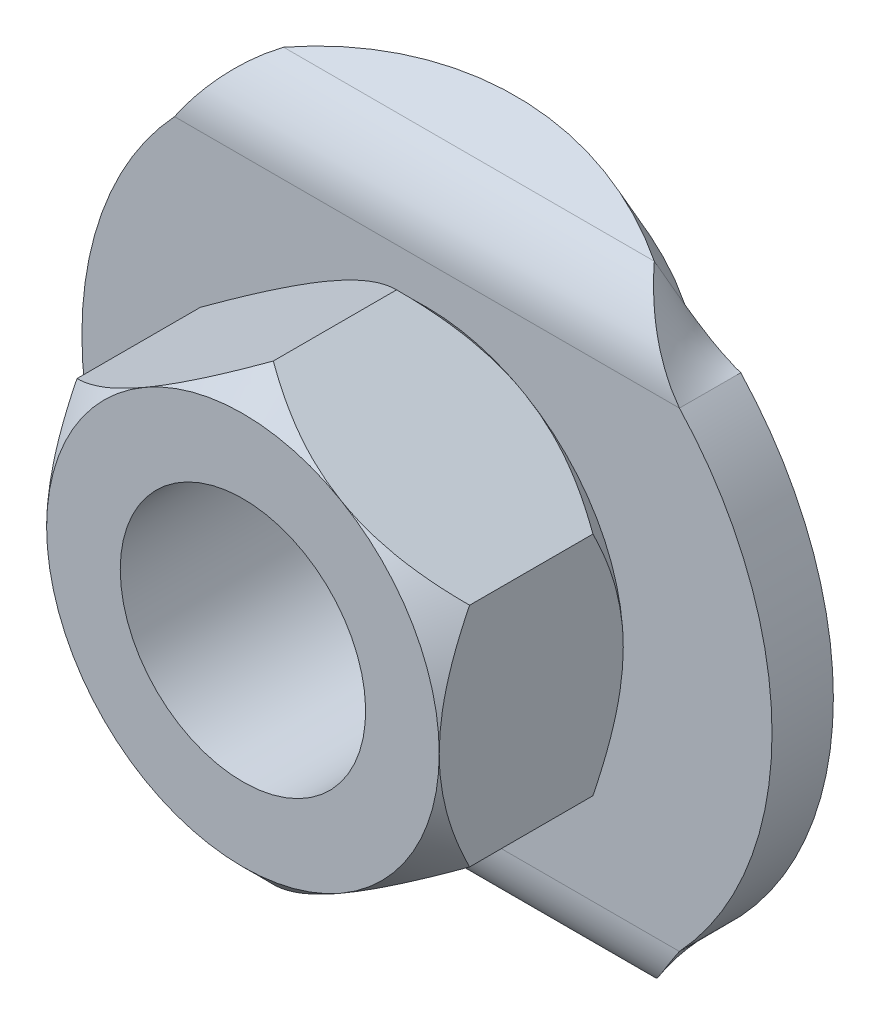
ISO-10303-21;
HEADER;
FILE_DESCRIPTION(('STEP AP214'),'2;1');
FILE_NAME('part.step','',(''),(''),'','','');
FILE_SCHEMA(('AUTOMOTIVE_DESIGN { 1 0 10303 214 1 1 1 1 }'));
ENDSEC;
DATA;
#1=APPLICATION_CONTEXT('core data for automotive mechanical design processes');
#2=APPLICATION_PROTOCOL_DEFINITION('international standard','automotive_design',2000,#1);
#3=PRODUCT_CONTEXT('',#1,'mechanical');
#4=PRODUCT('Part','Part','',(#3));
#5=PRODUCT_RELATED_PRODUCT_CATEGORY('part','',(#4));
#6=PRODUCT_DEFINITION_FORMATION('','',#4);
#7=PRODUCT_DEFINITION_CONTEXT('part definition',#1,'design');
#8=PRODUCT_DEFINITION('design','',#6,#7);
#9=PRODUCT_DEFINITION_SHAPE('','',#8);
#10=(LENGTH_UNIT() NAMED_UNIT(*) SI_UNIT(.MILLI.,.METRE.));
#11=(NAMED_UNIT(*) PLANE_ANGLE_UNIT() SI_UNIT($,.RADIAN.));
#12=(NAMED_UNIT(*) SI_UNIT($,.STERADIAN.) SOLID_ANGLE_UNIT());
#13=UNCERTAINTY_MEASURE_WITH_UNIT(LENGTH_MEASURE(1.E-05),#10,'distance_accuracy_value','');
#14=(GEOMETRIC_REPRESENTATION_CONTEXT(3) GLOBAL_UNCERTAINTY_ASSIGNED_CONTEXT((#13)) GLOBAL_UNIT_ASSIGNED_CONTEXT((#10,
#11,#12)) REPRESENTATION_CONTEXT('',''));
#15=CARTESIAN_POINT('',(0.,0.,0.));
#16=DIRECTION('',(0.,0.,1.));
#17=DIRECTION('',(1.,0.,0.));
#18=AXIS2_PLACEMENT_3D('',#15,#16,#17);
#19=CARTESIAN_POINT('',(0.,0.,7.0039760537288));
#20=DIRECTION('',(0.,0.,-1.));
#21=DIRECTION('',(0.5,0.866025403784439,0.));
#22=AXIS2_PLACEMENT_3D('',#19,#20,#21);
#23=CONICAL_SURFACE('',#22,7.39602394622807,0.785398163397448);
#24=CARTESIAN_POINT('',(6.3999999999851,3.6950417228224,7.00991655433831));
#25=CARTESIAN_POINT('',(6.28925599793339,3.75897980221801,7.07384478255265));
#26=CARTESIAN_POINT('',(6.17765565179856,3.82341229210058,7.13579860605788));
#27=CARTESIAN_POINT('',(5.95256973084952,3.95336570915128,7.25515410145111));
#28=CARTESIAN_POINT('',(5.83908310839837,4.01888724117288,7.3125531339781));
#29=CARTESIAN_POINT('',(5.4943726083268,4.21790594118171,7.47755291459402));
#30=CARTESIAN_POINT('',(5.26020699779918,4.35310151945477,7.57718369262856));
#31=CARTESIAN_POINT('',(4.79109462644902,4.62394367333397,7.74632080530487));
#32=CARTESIAN_POINT('',(4.55636836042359,4.75946294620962,7.81661849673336));
#33=CARTESIAN_POINT('',(4.20052762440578,4.96490769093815,7.89794625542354));
#34=CARTESIAN_POINT('',(4.08143702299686,5.03366468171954,7.9210221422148));
#35=CARTESIAN_POINT('',(3.84226113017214,5.17175294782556,7.95862409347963));
#36=CARTESIAN_POINT('',(3.72217616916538,5.24108403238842,7.97315289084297));
#37=CARTESIAN_POINT('',(3.5350996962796,5.34909268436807,7.98877491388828));
#38=CARTESIAN_POINT('',(3.46829233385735,5.38766393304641,7.99297018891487));
#39=CARTESIAN_POINT('',(3.33432540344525,5.46500977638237,7.99858983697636));
#40=CARTESIAN_POINT('',(3.26716548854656,5.50378457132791,8.00000316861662));
#41=CARTESIAN_POINT('',(3.19999999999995,5.5425625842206,7.9999999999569));
#42=B_SPLINE_CURVE_WITH_KNOTS('',3,(#24,#25,#26,#27,#28,#29,#30,#31,#32,#33,#34,#35,#36,#37,#38,
#39,#40,#41),.UNSPECIFIED.,.F.,.F.,(4,2,2,2,2,2,2,2,4),(0.,0.428870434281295,0.857987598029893,
1.721301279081,2.55952433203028,2.97761259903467,3.39556711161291,3.62729196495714,
3.85993468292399),.UNSPECIFIED.);
#43=CARTESIAN_POINT('',(6.3999999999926,3.69504172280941,7.00991655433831));
#44=VERTEX_POINT('',#43);
#45=CARTESIAN_POINT('',(3.1999999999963,5.54256258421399,7.9999999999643));
#46=VERTEX_POINT('',#45);
#47=EDGE_CURVE('E646',#44,#46,#42,.T.);
#48=ORIENTED_EDGE('',*,*,#47,.T.);
#49=CARTESIAN_POINT('',(0.,0.,7.99999999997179));
#50=DIRECTION('',(0.,0.,-1.));
#51=DIRECTION('',(0.5,0.866025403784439,0.));
#52=AXIS2_PLACEMENT_3D('',#49,#50,#51);
#53=CIRCLE('',#52,6.39999999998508);
#54=CARTESIAN_POINT('',(6.39999999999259,0.,7.9999999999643));
#55=VERTEX_POINT('',#54);
#56=EDGE_CURVE('E598',#55,#46,#53,.F.);
#57=ORIENTED_EDGE('',*,*,#56,.F.);
#58=CARTESIAN_POINT('',(6.40000000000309,0.,7.9999999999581));
#59=CARTESIAN_POINT('',(6.40000000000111,0.0982899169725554,8.00001141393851));
#60=CARTESIAN_POINT('',(6.4000000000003,0.196575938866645,7.9977360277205));
#61=CARTESIAN_POINT('',(6.3999999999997,0.392926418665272,7.98869643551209));
#62=CARTESIAN_POINT('',(6.39999999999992,0.49099090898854,7.98193293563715));
#63=CARTESIAN_POINT('',(6.40000000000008,0.686543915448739,7.96401757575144));
#64=CARTESIAN_POINT('',(6.40000000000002,0.784033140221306,7.95287343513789));
#65=CARTESIAN_POINT('',(6.39999999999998,0.978430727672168,7.92635728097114));
#66=CARTESIAN_POINT('',(6.39999999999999,1.07533907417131,7.91098515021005));
#67=CARTESIAN_POINT('',(6.40000000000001,1.36203560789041,7.85934256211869));
#68=CARTESIAN_POINT('',(6.4,1.55079851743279,7.81725852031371));
#69=CARTESIAN_POINT('',(6.39999999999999,1.92470633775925,7.71929042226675));
#70=CARTESIAN_POINT('',(6.4,2.10985009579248,7.66340204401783));
#71=CARTESIAN_POINT('',(6.4,2.41265138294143,7.5612727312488));
#72=CARTESIAN_POINT('',(6.4,2.53146367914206,7.51839924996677));
#73=CARTESIAN_POINT('',(6.4,2.76734678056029,7.42817545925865));
#74=CARTESIAN_POINT('',(6.4,2.88441794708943,7.38082609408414));
#75=CARTESIAN_POINT('',(6.4,3.11806570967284,7.28164198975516));
#76=CARTESIAN_POINT('',(6.4,3.23462467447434,7.22976593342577));
#77=CARTESIAN_POINT('',(6.4,3.46606944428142,7.12242102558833));
#78=CARTESIAN_POINT('',(6.4,3.58095536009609,7.06695241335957));
#79=CARTESIAN_POINT('',(6.4,3.69504172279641,7.00991655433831));
#80=B_SPLINE_CURVE_WITH_KNOTS('',3,(#58,#59,#60,#61,#62,#63,#64,#65,#66,#67,#68,#69,#70,#71,#72,
#73,#74,#75,#76,#77,#78,#79),.UNSPECIFIED.,.F.,.F.,(4,2,2,2,2,2,2,2,2,2,4),(0.,
0.294836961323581,0.589627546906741,0.883900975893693,1.1781825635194,1.75772429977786,
2.33744771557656,2.71629282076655,3.09505818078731,3.47774006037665,3.8603964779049),.UNSPECIFIED.);
#81=EDGE_CURVE('E588',#55,#44,#80,.T.);
#82=ORIENTED_EDGE('',*,*,#81,.T.);
#83=EDGE_LOOP('',(#48,#57,#82));
#84=FACE_BOUND('',#83,.T.);
#85=ADVANCED_FACE('F14',(#84),#23,.T.);
#86=CARTESIAN_POINT('',(0.,0.,7.0039760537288));
#87=DIRECTION('',(0.,0.,-1.));
#88=DIRECTION('',(0.5,0.866025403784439,0.));
#89=AXIS2_PLACEMENT_3D('',#86,#87,#88);
#90=CONICAL_SURFACE('',#89,7.39602394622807,0.785398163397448);
#91=CARTESIAN_POINT('',(-1.49018445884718E-11,7.3900834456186,7.0099165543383));
#92=CARTESIAN_POINT('',(-0.110744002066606,7.32614536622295,7.0738447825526));
#93=CARTESIAN_POINT('',(-0.222344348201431,7.26171287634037,7.13579860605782));
#94=CARTESIAN_POINT('',(-0.447430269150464,7.13175945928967,7.25515410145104));
#95=CARTESIAN_POINT('',(-0.560916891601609,7.06623792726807,7.31255313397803));
#96=CARTESIAN_POINT('',(-0.905627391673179,6.86721922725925,7.47755291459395));
#97=CARTESIAN_POINT('',(-1.1397930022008,6.73202364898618,7.57718369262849));
#98=CARTESIAN_POINT('',(-1.60890537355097,6.46118149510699,7.74632080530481));
#99=CARTESIAN_POINT('',(-1.8436316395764,6.32566222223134,7.81661849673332));
#100=CARTESIAN_POINT('',(-2.1994723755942,6.1202174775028,7.89794625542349));
#101=CARTESIAN_POINT('',(-2.31856297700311,6.05146048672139,7.92102214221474));
#102=CARTESIAN_POINT('',(-2.55773886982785,5.91337222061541,7.9586240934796));
#103=CARTESIAN_POINT('',(-2.67782383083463,5.8440411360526,7.97315289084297));
#104=CARTESIAN_POINT('',(-2.86490030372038,5.73603248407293,7.98877491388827));
#105=CARTESIAN_POINT('',(-2.93170766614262,5.69746123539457,7.99297018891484));
#106=CARTESIAN_POINT('',(-3.06567459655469,5.62011539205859,7.99858983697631));
#107=CARTESIAN_POINT('',(-3.13283451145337,5.58134059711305,8.00000316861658));
#108=CARTESIAN_POINT('',(-3.2,5.54256258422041,7.9999999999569));
#109=B_SPLINE_CURVE_WITH_KNOTS('',3,(#91,#92,#93,#94,#95,#96,#97,#98,#99,#100,#101,#102,#103,
#104,#105,#106,#107,#108),.UNSPECIFIED.,.F.,.F.,(4,2,2,2,2,2,2,2,4),(0.,0.42887043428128,
0.857987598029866,1.72130127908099,2.55952433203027,2.97761259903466,3.39556711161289,
3.6272919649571,3.85993468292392),.UNSPECIFIED.);
#110=CARTESIAN_POINT('',(0.,7.3900834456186,7.0099165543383));
#111=VERTEX_POINT('',#110);
#112=CARTESIAN_POINT('',(-3.19999999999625,5.542562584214,7.99999999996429));
#113=VERTEX_POINT('',#112);
#114=EDGE_CURVE('E642',#111,#113,#109,.T.);
#115=ORIENTED_EDGE('',*,*,#114,.T.);
#116=CARTESIAN_POINT('',(0.,0.,7.99999999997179));
#117=DIRECTION('',(0.,0.,-1.));
#118=DIRECTION('',(0.5,0.866025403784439,0.));
#119=AXIS2_PLACEMENT_3D('',#116,#117,#118);
#120=CIRCLE('',#119,6.39999999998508);
#121=EDGE_CURVE('E596',#46,#113,#120,.F.);
#122=ORIENTED_EDGE('',*,*,#121,.F.);
#123=CARTESIAN_POINT('',(3.20000000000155,5.542562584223,7.9999999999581));
#124=CARTESIAN_POINT('',(3.11487843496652,5.59170754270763,8.00001141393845));
#125=CARTESIAN_POINT('',(3.02976024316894,5.64085055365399,7.99773602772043));
#126=CARTESIAN_POINT('',(2.85971573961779,5.73902579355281,7.988696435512));
#127=CARTESIAN_POINT('',(2.77478939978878,5.78805803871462,7.98193293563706));
#128=CARTESIAN_POINT('',(2.60543552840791,5.88583454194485,7.96401757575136));
#129=CARTESIAN_POINT('',(2.5210073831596,5.93457915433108,7.95287343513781));
#130=CARTESIAN_POINT('',(2.35265413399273,6.03177794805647,7.92635728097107));
#131=CARTESIAN_POINT('',(2.26872904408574,6.08023212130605,7.91098515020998));
#132=CARTESIAN_POINT('',(2.02044256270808,6.22358038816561,7.85934256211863));
#133=CARTESIAN_POINT('',(1.85696908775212,6.31796184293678,7.81725852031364));
#134=CARTESIAN_POINT('',(1.53315541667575,6.5049157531,7.71929042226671));
#135=CARTESIAN_POINT('',(1.37281621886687,6.59748763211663,7.66340204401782));
#136=CARTESIAN_POINT('',(1.11058261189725,6.7488882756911,7.56127273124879));
#137=CARTESIAN_POINT('',(1.00768814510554,6.80829442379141,7.51839924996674));
#138=CARTESIAN_POINT('',(0.803407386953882,6.92623597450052,7.42817545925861));
#139=CARTESIAN_POINT('',(0.702020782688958,6.9847715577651,7.38082609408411));
#140=CARTESIAN_POINT('',(0.499675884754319,7.10159543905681,7.28164198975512));
#141=CARTESIAN_POINT('',(0.398732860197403,7.15987492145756,7.22976593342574));
#142=CARTESIAN_POINT('',(0.198295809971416,7.27559730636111,7.1224210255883));
#143=CARTESIAN_POINT('',(0.0988016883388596,7.33304026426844,7.06695241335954));
#144=CARTESIAN_POINT('',(1.49978492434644E-11,7.3900834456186,7.0099165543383));
#145=B_SPLINE_CURVE_WITH_KNOTS('',3,(#123,#124,#125,#126,#127,#128,#129,#130,#131,#132,#133,
#134,#135,#136,#137,#138,#139,#140,#141,#142,#143,#144),.UNSPECIFIED.,.F.,.F.,(4,2,2,2,2,2,2,2,
2,2,4),(0.,0.294836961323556,0.589627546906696,0.883900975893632,1.17818256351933,
1.75772429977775,2.33744771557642,2.71629282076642,3.09505818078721,3.47774006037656,
3.86039647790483),.UNSPECIFIED.);
#146=EDGE_CURVE('E647',#46,#111,#145,.T.);
#147=ORIENTED_EDGE('',*,*,#146,.T.);
#148=EDGE_LOOP('',(#115,#122,#147));
#149=FACE_BOUND('',#148,.T.);
#150=ADVANCED_FACE('F667',(#149),#90,.T.);
#151=CARTESIAN_POINT('',(0.,0.,7.0039760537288));
#152=DIRECTION('',(0.,0.,-1.));
#153=DIRECTION('',(0.5,0.866025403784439,0.));
#154=AXIS2_PLACEMENT_3D('',#151,#152,#153);
#155=CONICAL_SURFACE('',#154,7.39602394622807,0.785398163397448);
#156=CARTESIAN_POINT('',(0.,0.,7.99999999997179));
#157=DIRECTION('',(0.,0.,-1.));
#158=DIRECTION('',(0.5,0.866025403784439,0.));
#159=AXIS2_PLACEMENT_3D('',#156,#157,#158);
#160=CIRCLE('',#159,6.39999999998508);
#161=CARTESIAN_POINT('',(-6.39999999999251,0.,7.99999999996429));
#162=VERTEX_POINT('',#161);
#163=EDGE_CURVE('E594',#113,#162,#160,.F.);
#164=ORIENTED_EDGE('',*,*,#163,.F.);
#165=CARTESIAN_POINT('',(-3.20000000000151,5.54256258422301,7.9999999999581));
#166=CARTESIAN_POINT('',(-3.28512156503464,5.4934176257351,8.00001141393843));
#167=CARTESIAN_POINT('',(-3.37023975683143,5.44427461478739,7.99773602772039));
#168=CARTESIAN_POINT('',(-3.540284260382,5.3460993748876,7.98869643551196));
#169=CARTESIAN_POINT('',(-3.62521060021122,5.29706712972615,7.98193293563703));
#170=CARTESIAN_POINT('',(-3.79456447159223,5.19929062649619,7.96401757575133));
#171=CARTESIAN_POINT('',(-3.87899261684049,5.15054601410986,7.95287343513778));
#172=CARTESIAN_POINT('',(-4.0473458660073,5.05334722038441,7.92635728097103));
#173=CARTESIAN_POINT('',(-4.1312709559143,5.00489304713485,7.91098515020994));
#174=CARTESIAN_POINT('',(-4.37955743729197,4.86154478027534,7.8593425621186));
#175=CARTESIAN_POINT('',(-4.54303091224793,4.76716332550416,7.81725852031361));
#176=CARTESIAN_POINT('',(-4.86684458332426,4.58020941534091,7.71929042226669));
#177=CARTESIAN_POINT('',(-5.02718378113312,4.48763753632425,7.66340204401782));
#178=CARTESIAN_POINT('',(-5.28941738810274,4.33623689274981,7.56127273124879));
#179=CARTESIAN_POINT('',(-5.39231185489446,4.27683074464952,7.51839924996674));
#180=CARTESIAN_POINT('',(-5.59659261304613,4.15888919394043,7.4281754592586));
#181=CARTESIAN_POINT('',(-5.69797921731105,4.10035361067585,7.3808260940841));
#182=CARTESIAN_POINT('',(-5.90032411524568,3.98352972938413,7.28164198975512));
#183=CARTESIAN_POINT('',(-6.00126713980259,3.92525024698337,7.22976593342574));
#184=CARTESIAN_POINT('',(-6.20170419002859,3.80952786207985,7.1224210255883));
#185=CARTESIAN_POINT('',(-6.30119831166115,3.75208490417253,7.06695241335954));
#186=CARTESIAN_POINT('',(-6.39999999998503,3.69504172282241,7.0099165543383));
#187=B_SPLINE_CURVE_WITH_KNOTS('',3,(#165,#166,#167,#168,#169,#170,#171,#172,#173,#174,#175,
#176,#177,#178,#179,#180,#181,#182,#183,#184,#185,#186),.UNSPECIFIED.,.F.,.F.,(4,2,2,2,2,2,2,2,
2,2,4),(0.,0.294836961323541,0.589627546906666,0.883900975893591,1.17818256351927,
1.75772429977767,2.33744771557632,2.71629282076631,3.09505818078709,3.47774006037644,
3.8603964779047),.UNSPECIFIED.);
#188=CARTESIAN_POINT('',(-6.39999999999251,3.69504172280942,7.0099165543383));
#189=VERTEX_POINT('',#188);
#190=EDGE_CURVE('E643',#113,#189,#187,.T.);
#191=ORIENTED_EDGE('',*,*,#190,.T.);
#192=CARTESIAN_POINT('',(-6.4,3.69504172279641,7.0099165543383));
#193=CARTESIAN_POINT('',(-6.4,3.56716556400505,7.0738447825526));
#194=CARTESIAN_POINT('',(-6.4,3.43830058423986,7.13579860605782));
#195=CARTESIAN_POINT('',(-6.4,3.17839375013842,7.25515410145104));
#196=CARTESIAN_POINT('',(-6.4,3.04735068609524,7.31255313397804));
#197=CARTESIAN_POINT('',(-6.4,2.64931328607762,7.47755291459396));
#198=CARTESIAN_POINT('',(-6.4,2.37892212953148,7.5771836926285));
#199=CARTESIAN_POINT('',(-6.4,1.83723782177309,7.74632080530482));
#200=CARTESIAN_POINT('',(-6.4,1.56619927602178,7.81661849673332));
#201=CARTESIAN_POINT('',(-6.4,1.15530978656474,7.89794625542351));
#202=CARTESIAN_POINT('',(-6.4,1.01779580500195,7.92102214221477));
#203=CARTESIAN_POINT('',(-6.4,0.741619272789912,7.9586240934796));
#204=CARTESIAN_POINT('',(-6.4,0.60295710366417,7.97315289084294));
#205=CARTESIAN_POINT('',(-6.4,0.386939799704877,7.98877491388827));
#206=CARTESIAN_POINT('',(-6.4,0.309797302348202,7.99297018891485));
#207=CARTESIAN_POINT('',(-6.4,0.155105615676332,7.99858983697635));
#208=CARTESIAN_POINT('',(-6.4,0.0775560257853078,8.00000316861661));
#209=CARTESIAN_POINT('',(-6.4,0.,7.99999999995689));
#210=B_SPLINE_CURVE_WITH_KNOTS('',3,(#192,#193,#194,#195,#196,#197,#198,#199,#200,#201,#202,
#203,#204,#205,#206,#207,#208,#209),.UNSPECIFIED.,.F.,.F.,(4,2,2,2,2,2,2,2,4),(0.,
0.42887043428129,0.857987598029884,1.72130127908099,2.55952433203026,2.97761259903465,
3.39556711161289,3.6272919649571,3.85993468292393),.UNSPECIFIED.);
#211=EDGE_CURVE('E638',#189,#162,#210,.T.);
#212=ORIENTED_EDGE('',*,*,#211,.T.);
#213=EDGE_LOOP('',(#164,#191,#212));
#214=FACE_BOUND('',#213,.T.);
#215=ADVANCED_FACE('F671',(#214),#155,.T.);
#216=CARTESIAN_POINT('',(0.,0.,7.0039760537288));
#217=DIRECTION('',(0.,0.,-1.));
#218=DIRECTION('',(0.5,0.866025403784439,0.));
#219=AXIS2_PLACEMENT_3D('',#216,#217,#218);
#220=CONICAL_SURFACE('',#219,7.39602394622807,0.785398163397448);
#221=CARTESIAN_POINT('',(-6.39999999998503,-3.6950417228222,7.0099165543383));
#222=CARTESIAN_POINT('',(-6.28925599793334,-3.75897980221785,7.07384478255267));
#223=CARTESIAN_POINT('',(-6.17765565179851,-3.82341229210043,7.13579860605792));
#224=CARTESIAN_POINT('',(-5.95256973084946,-3.95336570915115,7.25515410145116));
#225=CARTESIAN_POINT('',(-5.8390831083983,-4.01888724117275,7.31255313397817));
#226=CARTESIAN_POINT('',(-5.49437260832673,-4.21790594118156,7.47755291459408));
#227=CARTESIAN_POINT('',(-5.26020699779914,-4.35310151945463,7.57718369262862));
#228=CARTESIAN_POINT('',(-4.791094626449,-4.6239436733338,7.74632080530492));
#229=CARTESIAN_POINT('',(-4.55636836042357,-4.75946294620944,7.8166184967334));
#230=CARTESIAN_POINT('',(-4.20052762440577,-4.96490769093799,7.89794625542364));
#231=CARTESIAN_POINT('',(-4.08143702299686,-5.0336646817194,7.92102214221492));
#232=CARTESIAN_POINT('',(-3.84226113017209,-5.17175294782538,7.95862409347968));
#233=CARTESIAN_POINT('',(-3.72217616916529,-5.24108403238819,7.97315289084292));
#234=CARTESIAN_POINT('',(-3.53509969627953,-5.34909268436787,7.9887749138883));
#235=CARTESIAN_POINT('',(-3.46829233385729,-5.38766393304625,7.99297018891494));
#236=CARTESIAN_POINT('',(-3.33432540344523,-5.46500977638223,7.99858983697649));
#237=CARTESIAN_POINT('',(-3.26716548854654,-5.50378457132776,8.00000316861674));
#238=CARTESIAN_POINT('',(-3.19999999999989,-5.54256258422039,7.9999999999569));
#239=B_SPLINE_CURVE_WITH_KNOTS('',3,(#221,#222,#223,#224,#225,#226,#227,#228,#229,#230,#231,
#232,#233,#234,#235,#236,#237,#238),.UNSPECIFIED.,.F.,.F.,(4,2,2,2,2,2,2,2,4),(0.,
0.428870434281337,0.857987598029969,1.72130127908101,2.55952433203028,2.97761259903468,
3.39556711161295,3.62729196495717,3.859934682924),.UNSPECIFIED.);
#240=CARTESIAN_POINT('',(-6.39999999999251,-3.6950417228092,7.0099165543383));
#241=VERTEX_POINT('',#240);
#242=CARTESIAN_POINT('',(-3.19999999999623,-5.54256258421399,7.99999999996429));
#243=VERTEX_POINT('',#242);
#244=EDGE_CURVE('E626',#241,#243,#239,.T.);
#245=ORIENTED_EDGE('',*,*,#244,.T.);
#246=CARTESIAN_POINT('',(0.,0.,7.99999999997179));
#247=DIRECTION('',(0.,0.,-1.));
#248=DIRECTION('',(0.5,0.866025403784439,0.));
#249=AXIS2_PLACEMENT_3D('',#246,#247,#248);
#250=CIRCLE('',#249,6.39999999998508);
#251=EDGE_CURVE('E18',#162,#243,#250,.F.);
#252=ORIENTED_EDGE('',*,*,#251,.F.);
#253=CARTESIAN_POINT('',(-6.40000000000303,0.,7.99999999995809));
#254=CARTESIAN_POINT('',(-6.40000000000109,-0.0982899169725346,8.00001141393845));
#255=CARTESIAN_POINT('',(-6.40000000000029,-0.196575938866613,7.99773602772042));
#256=CARTESIAN_POINT('',(-6.39999999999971,-0.39292641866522,7.98869643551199));
#257=CARTESIAN_POINT('',(-6.39999999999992,-0.490990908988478,7.98193293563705));
#258=CARTESIAN_POINT('',(-6.40000000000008,-0.686543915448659,7.96401757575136));
#259=CARTESIAN_POINT('',(-6.40000000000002,-0.784033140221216,7.95287343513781));
#260=CARTESIAN_POINT('',(-6.39999999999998,-0.97843072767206,7.92635728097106));
#261=CARTESIAN_POINT('',(-6.39999999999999,-1.07533907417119,7.91098515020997));
#262=CARTESIAN_POINT('',(-6.40000000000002,-1.36203560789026,7.85934256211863));
#263=CARTESIAN_POINT('',(-6.4,-1.55079851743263,7.81725852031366));
#264=CARTESIAN_POINT('',(-6.4,-1.92470633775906,7.71929042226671));
#265=CARTESIAN_POINT('',(-6.4,-2.10985009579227,7.6634020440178));
#266=CARTESIAN_POINT('',(-6.4,-2.41265138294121,7.56127273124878));
#267=CARTESIAN_POINT('',(-6.4,-2.53146367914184,7.51839924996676));
#268=CARTESIAN_POINT('',(-6.4,-2.76734678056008,7.42817545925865));
#269=CARTESIAN_POINT('',(-6.4,-2.88441794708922,7.38082609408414));
#270=CARTESIAN_POINT('',(-6.4,-3.11806570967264,7.28164198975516));
#271=CARTESIAN_POINT('',(-6.4,-3.23462467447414,7.22976593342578));
#272=CARTESIAN_POINT('',(-6.4,-3.46606944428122,7.12242102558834));
#273=CARTESIAN_POINT('',(-6.4,-3.58095536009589,7.06695241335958));
#274=CARTESIAN_POINT('',(-6.4,-3.69504172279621,7.0099165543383));
#275=B_SPLINE_CURVE_WITH_KNOTS('',3,(#253,#254,#255,#256,#257,#258,#259,#260,#261,#262,#263,
#264,#265,#266,#267,#268,#269,#270,#271,#272,#273,#274),.UNSPECIFIED.,.F.,.F.,(4,2,2,2,2,2,2,2,
2,2,4),(0.,0.294836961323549,0.58962754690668,0.883900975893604,1.17818256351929,
1.75772429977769,2.33744771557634,2.71629282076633,3.0950581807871,3.47774006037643,
3.86039647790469),.UNSPECIFIED.);
#276=EDGE_CURVE('E639',#162,#241,#275,.T.);
#277=ORIENTED_EDGE('',*,*,#276,.T.);
#278=EDGE_LOOP('',(#245,#252,#277));
#279=FACE_BOUND('',#278,.T.);
#280=ADVANCED_FACE('F765',(#279),#220,.T.);
#281=CARTESIAN_POINT('',(0.,0.,7.0039760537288));
#282=DIRECTION('',(0.,0.,-1.));
#283=DIRECTION('',(0.5,0.866025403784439,0.));
#284=AXIS2_PLACEMENT_3D('',#281,#282,#283);
#285=CONICAL_SURFACE('',#284,7.39602394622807,0.785398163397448);
#286=CARTESIAN_POINT('',(1.49886523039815E-11,-7.39008344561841,7.0099165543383));
#287=CARTESIAN_POINT('',(0.110744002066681,-7.32614536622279,7.0738447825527));
#288=CARTESIAN_POINT('',(0.22234434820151,-7.26171287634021,7.13579860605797));
#289=CARTESIAN_POINT('',(0.447430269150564,-7.1317594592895,7.25515410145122));
#290=CARTESIAN_POINT('',(0.560916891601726,-7.0662379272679,7.31255313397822));
#291=CARTESIAN_POINT('',(0.905627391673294,-6.86721922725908,7.47755291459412));
#292=CARTESIAN_POINT('',(1.13979300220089,-6.73202364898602,7.57718369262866));
#293=CARTESIAN_POINT('',(1.60890537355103,-6.46118149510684,7.74632080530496));
#294=CARTESIAN_POINT('',(1.84363163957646,-6.32566222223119,7.81661849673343));
#295=CARTESIAN_POINT('',(2.19947237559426,-6.12021747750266,7.89794625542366));
#296=CARTESIAN_POINT('',(2.31856297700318,-6.05146048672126,7.92102214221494));
#297=CARTESIAN_POINT('',(2.55773886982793,-5.91337222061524,7.95862409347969));
#298=CARTESIAN_POINT('',(2.67782383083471,-5.84404113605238,7.97315289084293));
#299=CARTESIAN_POINT('',(2.86490030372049,-5.73603248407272,7.9887749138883));
#300=CARTESIAN_POINT('',(2.93170766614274,-5.69746123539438,7.99297018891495));
#301=CARTESIAN_POINT('',(3.06567459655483,-5.62011539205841,7.99858983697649));
#302=CARTESIAN_POINT('',(3.13283451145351,-5.58134059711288,8.00000316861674));
#303=CARTESIAN_POINT('',(3.20000000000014,-5.54256258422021,7.9999999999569));
#304=B_SPLINE_CURVE_WITH_KNOTS('',3,(#286,#287,#288,#289,#290,#291,#292,#293,#294,#295,#296,
#297,#298,#299,#300,#301,#302,#303),.UNSPECIFIED.,.F.,.F.,(4,2,2,2,2,2,2,2,4),(0.,
0.428870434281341,0.857987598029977,1.72130127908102,2.55952433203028,2.97761259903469,
3.39556711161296,3.62729196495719,3.85993468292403),.UNSPECIFIED.);
#305=CARTESIAN_POINT('',(7.49117744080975E-12,-7.390083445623,7.009916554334));
#306=VERTEX_POINT('',#305);
#307=CARTESIAN_POINT('',(3.19999999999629,-5.542562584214,7.9999999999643));
#308=VERTEX_POINT('',#307);
#309=EDGE_CURVE('E511',#306,#308,#304,.T.);
#310=ORIENTED_EDGE('',*,*,#309,.T.);
#311=CARTESIAN_POINT('',(0.,0.,7.99999999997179));
#312=DIRECTION('',(0.,0.,-1.));
#313=DIRECTION('',(0.5,0.866025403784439,0.));
#314=AXIS2_PLACEMENT_3D('',#311,#312,#313);
#315=CIRCLE('',#314,6.39999999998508);
#316=EDGE_CURVE('E601',#243,#308,#315,.F.);
#317=ORIENTED_EDGE('',*,*,#316,.F.);
#318=CARTESIAN_POINT('',(-3.20000000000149,-5.542562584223,7.99999999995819));
#319=CARTESIAN_POINT('',(-3.11487843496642,-5.59170754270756,8.00001141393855));
#320=CARTESIAN_POINT('',(-3.02976024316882,-5.6408505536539,7.99773602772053));
#321=CARTESIAN_POINT('',(-2.85971573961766,-5.7390257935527,7.9886964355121));
#322=CARTESIAN_POINT('',(-2.77478939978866,-5.78805803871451,7.98193293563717));
#323=CARTESIAN_POINT('',(-2.60543552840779,-5.88583454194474,7.96401757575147));
#324=CARTESIAN_POINT('',(-2.52100738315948,-5.93457915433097,7.95287343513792));
#325=CARTESIAN_POINT('',(-2.35265413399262,-6.03177794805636,7.92635728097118));
#326=CARTESIAN_POINT('',(-2.26872904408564,-6.08023212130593,7.91098515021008));
#327=CARTESIAN_POINT('',(-2.02044256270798,-6.22358038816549,7.85934256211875));
#328=CARTESIAN_POINT('',(-1.85696908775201,-6.31796184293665,7.8172585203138));
#329=CARTESIAN_POINT('',(-1.53315541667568,-6.50491575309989,7.71929042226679));
#330=CARTESIAN_POINT('',(-1.37281621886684,-6.59748763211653,7.66340204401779));
#331=CARTESIAN_POINT('',(-1.1105826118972,-6.748888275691,7.56127273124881));
#332=CARTESIAN_POINT('',(-1.00768814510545,-6.80829442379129,7.51839924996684));
#333=CARTESIAN_POINT('',(-0.803407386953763,-6.9262359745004,7.42817545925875));
#334=CARTESIAN_POINT('',(-0.70202078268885,-6.98477155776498,7.38082609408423));
#335=CARTESIAN_POINT('',(-0.499675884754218,-7.1015954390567,7.28164198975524));
#336=CARTESIAN_POINT('',(-0.3987328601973,-7.15987492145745,7.22976593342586));
#337=CARTESIAN_POINT('',(-0.198295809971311,-7.27559730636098,7.12242102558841));
#338=CARTESIAN_POINT('',(-0.0988016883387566,-7.3330402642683,7.06695241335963));
#339=CARTESIAN_POINT('',(-1.49110415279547E-11,-7.39008344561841,7.0099165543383));
#340=B_SPLINE_CURVE_WITH_KNOTS('',3,(#318,#319,#320,#321,#322,#323,#324,#325,#326,#327,#328,
#329,#330,#331,#332,#333,#334,#335,#336,#337,#338,#339),.UNSPECIFIED.,.F.,.F.,(4,2,2,2,2,2,2,2,
2,2,4),(0.,0.294836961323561,0.5896275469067,0.883900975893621,1.1781825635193,1.75772429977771,
2.33744771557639,2.71629282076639,3.09505818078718,3.47774006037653,3.8603964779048),.UNSPECIFIED.);
#341=EDGE_CURVE('E630',#243,#306,#340,.T.);
#342=ORIENTED_EDGE('',*,*,#341,.T.);
#343=EDGE_LOOP('',(#310,#317,#342));
#344=FACE_BOUND('',#343,.T.);
#345=ADVANCED_FACE('F768',(#344),#285,.T.);
#346=CARTESIAN_POINT('',(0.,0.,7.0039760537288));
#347=DIRECTION('',(0.,0.,-1.));
#348=DIRECTION('',(0.5,0.866025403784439,0.));
#349=AXIS2_PLACEMENT_3D('',#346,#347,#348);
#350=CONICAL_SURFACE('',#349,7.39602394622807,0.785398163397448);
#351=CARTESIAN_POINT('',(6.4,-3.69504172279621,7.00991655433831));
#352=CARTESIAN_POINT('',(6.4,-3.56716556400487,7.07384478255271));
#353=CARTESIAN_POINT('',(6.4,-3.43830058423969,7.13579860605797));
#354=CARTESIAN_POINT('',(6.4,-3.17839375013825,7.25515410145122));
#355=CARTESIAN_POINT('',(6.4,-3.04735068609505,7.31255313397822));
#356=CARTESIAN_POINT('',(6.4,-2.64931328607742,7.47755291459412));
#357=CARTESIAN_POINT('',(6.4,-2.3789221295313,7.57718369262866));
#358=CARTESIAN_POINT('',(6.4,-1.83723782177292,7.74632080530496));
#359=CARTESIAN_POINT('',(6.4,-1.56619927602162,7.81661849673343));
#360=CARTESIAN_POINT('',(6.4,-1.15530978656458,7.89794625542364));
#361=CARTESIAN_POINT('',(6.4,-1.01779580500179,7.92102214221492));
#362=CARTESIAN_POINT('',(6.4,-0.741619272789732,7.95862409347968));
#363=CARTESIAN_POINT('',(6.4,-0.602957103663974,7.97315289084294));
#364=CARTESIAN_POINT('',(6.4,-0.386939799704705,7.9887749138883));
#365=CARTESIAN_POINT('',(6.4,-0.309797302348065,7.99297018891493));
#366=CARTESIAN_POINT('',(6.4,-0.155105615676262,7.99858983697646));
#367=CARTESIAN_POINT('',(6.4,-0.0775560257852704,8.00000316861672));
#368=CARTESIAN_POINT('',(6.4,0.,7.9999999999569));
#369=B_SPLINE_CURVE_WITH_KNOTS('',3,(#351,#352,#353,#354,#355,#356,#357,#358,#359,#360,#361,
#362,#363,#364,#365,#366,#367,#368),.UNSPECIFIED.,.F.,.F.,(4,2,2,2,2,2,2,2,4),(0.,
0.428870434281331,0.857987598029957,1.72130127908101,2.55952433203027,2.97761259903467,
3.39556711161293,3.62729196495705,3.85993468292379),.UNSPECIFIED.);
#370=CARTESIAN_POINT('',(6.4,-3.695041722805,7.00991655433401));
#371=VERTEX_POINT('',#370);
#372=EDGE_CURVE('E579',#371,#55,#369,.T.);
#373=ORIENTED_EDGE('',*,*,#372,.T.);
#374=CARTESIAN_POINT('',(0.,0.,7.99999999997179));
#375=DIRECTION('',(0.,0.,-1.));
#376=DIRECTION('',(0.5,0.866025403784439,0.));
#377=AXIS2_PLACEMENT_3D('',#374,#375,#376);
#378=CIRCLE('',#377,6.39999999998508);
#379=EDGE_CURVE('E600',#308,#55,#378,.F.);
#380=ORIENTED_EDGE('',*,*,#379,.F.);
#381=CARTESIAN_POINT('',(3.20000000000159,-5.54256258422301,7.9999999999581));
#382=CARTESIAN_POINT('',(3.28512156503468,-5.49341762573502,8.00001141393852));
#383=CARTESIAN_POINT('',(3.37023975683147,-5.44427461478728,7.99773602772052));
#384=CARTESIAN_POINT('',(3.54028426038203,-5.34609937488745,7.98869643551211));
#385=CARTESIAN_POINT('',(3.62521060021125,-5.29706712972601,7.98193293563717));
#386=CARTESIAN_POINT('',(3.79456447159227,-5.19929062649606,7.96401757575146));
#387=CARTESIAN_POINT('',(3.87899261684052,-5.15054601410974,7.95287343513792));
#388=CARTESIAN_POINT('',(4.04734586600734,-5.05334722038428,7.92635728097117));
#389=CARTESIAN_POINT('',(4.13127095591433,-5.00489304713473,7.91098515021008));
#390=CARTESIAN_POINT('',(4.379557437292,-4.86154478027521,7.85934256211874));
#391=CARTESIAN_POINT('',(4.54303091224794,-4.767163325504,7.81725852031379));
#392=CARTESIAN_POINT('',(4.8668445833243,-4.58020941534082,7.71929042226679));
#393=CARTESIAN_POINT('',(5.02718378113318,-4.48763753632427,7.6634020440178));
#394=CARTESIAN_POINT('',(5.2894173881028,-4.33623689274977,7.56127273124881));
#395=CARTESIAN_POINT('',(5.39231185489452,-4.27683074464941,7.51839924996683));
#396=CARTESIAN_POINT('',(5.59659261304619,-4.15888919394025,7.42817545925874));
#397=CARTESIAN_POINT('',(5.69797921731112,-4.10035361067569,7.38082609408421));
#398=CARTESIAN_POINT('',(5.90032411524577,-3.98352972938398,7.28164198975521));
#399=CARTESIAN_POINT('',(6.00126713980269,-3.92525024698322,7.22976593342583));
#400=CARTESIAN_POINT('',(6.20170419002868,-3.80952786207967,7.12242102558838));
#401=CARTESIAN_POINT('',(6.30119831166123,-3.75208490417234,7.06695241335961));
#402=CARTESIAN_POINT('',(6.39999999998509,-3.6950417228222,7.00991655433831));
#403=B_SPLINE_CURVE_WITH_KNOTS('',3,(#381,#382,#383,#384,#385,#386,#387,#388,#389,#390,#391,
#392,#393,#394,#395,#396,#397,#398,#399,#400,#401,#402),.UNSPECIFIED.,.F.,.F.,(4,2,2,2,2,2,2,2,
2,2,4),(0.,0.294836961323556,0.58962754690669,0.883900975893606,1.17818256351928,
1.75772429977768,2.33744771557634,2.71629282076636,3.09505818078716,3.47774006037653,
3.86039647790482),.UNSPECIFIED.);
#404=EDGE_CURVE('E634',#308,#371,#403,.T.);
#405=ORIENTED_EDGE('',*,*,#404,.T.);
#406=EDGE_LOOP('',(#373,#380,#405));
#407=FACE_BOUND('',#406,.T.);
#408=ADVANCED_FACE('F500',(#407),#350,.T.);
#409=CARTESIAN_POINT('',(-3.44655424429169,-9.37995246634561,8.));
#410=DIRECTION('',(-0.5,0.866025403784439,0.));
#411=DIRECTION('',(-0.866025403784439,-0.5,0.));
#412=AXIS2_PLACEMENT_3D('',#409,#410,#411);
#413=PLANE('',#412);
#414=DIRECTION('',(0.,0.,1.));
#415=VECTOR('',#414,1.);
#416=CARTESIAN_POINT('',(0.,-7.39008344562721,8.));
#417=LINE('',#416,#415);
#418=CARTESIAN_POINT('',(3.06477894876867E-08,-7.3900834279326,2.9900834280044));
#419=VERTEX_POINT('',#418);
#420=EDGE_CURVE('E627',#306,#419,#417,.F.);
#421=ORIENTED_EDGE('',*,*,#420,.T.);
#422=CARTESIAN_POINT('',(3.2,-5.5425625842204,2.0000000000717));
#423=CARTESIAN_POINT('',(3.1148784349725,-5.59170754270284,1.99998858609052));
#424=CARTESIAN_POINT('',(3.0297602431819,-5.64085055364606,2.00226397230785));
#425=CARTESIAN_POINT('',(2.85971573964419,-5.73902579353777,2.01130356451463));
#426=CARTESIAN_POINT('',(2.77478939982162,-5.78805803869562,2.01806706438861));
#427=CARTESIAN_POINT('',(2.60543552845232,-5.885834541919,2.03598242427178));
#428=CARTESIAN_POINT('',(2.52100738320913,-5.93457915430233,2.04712656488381));
#429=CARTESIAN_POINT('',(2.35265413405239,-6.03177794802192,2.07364271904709));
#430=CARTESIAN_POINT('',(2.2687290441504,-6.0802321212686,2.08901484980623));
#431=CARTESIAN_POINT('',(2.02044256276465,-6.22358038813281,2.14065743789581));
#432=CARTESIAN_POINT('',(1.85696908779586,-6.3179618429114,2.18274147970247));
#433=CARTESIAN_POINT('',(1.53315541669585,-6.50491575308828,2.28070957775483));
#434=CARTESIAN_POINT('',(1.37281621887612,-6.59748763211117,2.33659795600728));
#435=CARTESIAN_POINT('',(1.11058261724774,-6.74888827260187,2.43872726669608));
#436=CARTESIAN_POINT('',(1.00768815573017,-6.80829441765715,2.48160074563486));
#437=CARTESIAN_POINT('',(0.803407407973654,-6.92623596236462,2.5718245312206));
#438=CARTESIAN_POINT('',(0.702020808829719,-6.9847715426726,2.61917389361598));
#439=CARTESIAN_POINT('',(0.499675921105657,-7.10159541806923,2.71835799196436));
#440=CARTESIAN_POINT('',(0.398732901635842,-7.15987489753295,2.77023404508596));
#441=CARTESIAN_POINT('',(0.198295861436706,-7.27559727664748,2.87757894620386));
#442=CARTESIAN_POINT('',(0.0988017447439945,-7.33304023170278,2.93304755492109));
#443=CARTESIAN_POINT('',(6.12953399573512E-08,-7.3900834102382,2.99008341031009));
#444=B_SPLINE_CURVE_WITH_KNOTS('',3,(#422,#423,#424,#425,#426,#427,#428,#429,#430,#431,#432,
#433,#434,#435,#436,#437,#438,#439,#440,#441,#442,#443),.UNSPECIFIED.,.F.,.F.,(4,2,2,2,2,2,2,2,
2,2,4),(0.,0.294836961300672,0.589627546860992,0.883900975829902,1.1781825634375,
1.75772429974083,2.33744771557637,2.71629280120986,3.09505814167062,3.47774000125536,
3.86039639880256),.UNSPECIFIED.);
#445=CARTESIAN_POINT('',(3.2,-5.5425625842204,2.));
#446=VERTEX_POINT('',#445);
#447=EDGE_CURVE('E482',#446,#419,#444,.T.);
#448=ORIENTED_EDGE('',*,*,#447,.F.);
#449=CARTESIAN_POINT('',(6.39999999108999,-3.69504169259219,2.99008346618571));
#450=CARTESIAN_POINT('',(6.28925600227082,-3.75897978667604,2.92615522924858));
#451=CARTESIAN_POINT('',(6.17765566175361,-3.82341228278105,2.86420140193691));
#452=CARTESIAN_POINT('',(5.95256974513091,-3.9533657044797,2.74484590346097));
#453=CARTESIAN_POINT('',(5.83908312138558,-4.0188872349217,2.68744687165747));
#454=CARTESIAN_POINT('',(5.49437261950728,-4.21790593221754,2.5224470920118));
#455=CARTESIAN_POINT('',(5.26020701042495,-4.35310151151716,2.42281631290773));
#456=CARTESIAN_POINT('',(4.79109464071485,-4.62394366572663,2.25367919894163));
#457=CARTESIAN_POINT('',(4.55636837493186,-4.75946293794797,2.18338150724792));
#458=CARTESIAN_POINT('',(4.20052763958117,-4.96490768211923,2.1020537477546));
#459=CARTESIAN_POINT('',(4.08143703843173,-5.03366467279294,2.07897786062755));
#460=CARTESIAN_POINT('',(3.84226114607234,-5.17175293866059,2.04137590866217));
#461=CARTESIAN_POINT('',(3.72217618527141,-5.24108402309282,2.02684711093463));
#462=CARTESIAN_POINT('',(3.53509970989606,-5.34909267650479,2.01122508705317));
#463=CARTESIAN_POINT('',(3.46829234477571,-5.38766392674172,2.00702981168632));
#464=CARTESIAN_POINT('',(3.33432540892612,-5.46500977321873,2.00141016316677));
#465=CARTESIAN_POINT('',(3.26716549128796,-5.50378456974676,1.99999683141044));
#466=CARTESIAN_POINT('',(3.2,-5.5425625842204,2.0000000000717));
#467=B_SPLINE_CURVE_WITH_KNOTS('',3,(#449,#450,#451,#452,#453,#454,#455,#456,#457,#458,#459,
#460,#461,#462,#463,#464,#465,#466),.UNSPECIFIED.,.F.,.F.,(4,2,2,2,2,2,2,2,4),(0.,
0.428870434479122,0.857987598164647,1.72130127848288,2.5595243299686,2.97761259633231,
3.3955671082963,3.62729197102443,3.85993469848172),.UNSPECIFIED.);
#468=CARTESIAN_POINT('',(6.4,-3.6950416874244,2.99008342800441));
#469=VERTEX_POINT('',#468);
#470=EDGE_CURVE('E521',#469,#446,#467,.T.);
#471=ORIENTED_EDGE('',*,*,#470,.F.);
#472=DIRECTION('',(0.,0.,1.));
#473=VECTOR('',#472,1.);
#474=CARTESIAN_POINT('',(6.4,-3.69504172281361,8.));
#475=LINE('',#474,#473);
#476=EDGE_CURVE('E631',#371,#469,#475,.F.);
#477=ORIENTED_EDGE('',*,*,#476,.F.);
#478=ORIENTED_EDGE('',*,*,#404,.F.);
#479=ORIENTED_EDGE('',*,*,#309,.F.);
#480=EDGE_LOOP('',(#421,#448,#471,#477,#478,#479));
#481=FACE_BOUND('',#480,.T.);
#482=ADVANCED_FACE('F496',(#481),#413,.F.);
#483=CARTESIAN_POINT('',(6.4,7.67477976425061,8.));
#484=DIRECTION('',(-1.,0.,0.));
#485=DIRECTION('',(0.,-1.,0.));
#486=AXIS2_PLACEMENT_3D('',#483,#484,#485);
#487=PLANE('',#486);
#488=ORIENTED_EDGE('',*,*,#476,.T.);
#489=CARTESIAN_POINT('',(6.4,0.,2.0000000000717));
#490=CARTESIAN_POINT('',(6.4,-0.0982899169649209,1.99998858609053));
#491=CARTESIAN_POINT('',(6.4,-0.196575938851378,2.00226397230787));
#492=CARTESIAN_POINT('',(6.4,-0.392926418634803,2.01130356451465));
#493=CARTESIAN_POINT('',(6.4,-0.4909909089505,2.01806706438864));
#494=CARTESIAN_POINT('',(6.4,-0.686543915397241,2.0359824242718));
#495=CARTESIAN_POINT('',(6.4,-0.784033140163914,2.04712656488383));
#496=CARTESIAN_POINT('',(6.4,-0.978430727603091,2.07364271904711));
#497=CARTESIAN_POINT('',(6.4,-1.07533907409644,2.08901484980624));
#498=CARTESIAN_POINT('',(6.4,-1.36203560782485,2.14065743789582));
#499=CARTESIAN_POINT('',(6.4,-1.55079851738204,2.18274147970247));
#500=CARTESIAN_POINT('',(6.4,-1.92470633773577,2.28070957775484));
#501=CARTESIAN_POINT('',(6.4,-2.10985009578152,2.33659795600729));
#502=CARTESIAN_POINT('',(6.4,-2.41265137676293,2.43872726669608));
#503=CARTESIAN_POINT('',(6.4,-2.53146366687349,2.48160074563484));
#504=CARTESIAN_POINT('',(6.4,-2.76734675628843,2.57182453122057));
#505=CARTESIAN_POINT('',(6.4,-2.88441791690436,2.61917389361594));
#506=CARTESIAN_POINT('',(6.4,-3.1180656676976,2.71835799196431));
#507=CARTESIAN_POINT('',(6.4,-3.23462462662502,2.7702340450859));
#508=CARTESIAN_POINT('',(6.4,-3.46606938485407,2.87757894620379));
#509=CARTESIAN_POINT('',(6.4,-3.58095529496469,2.93304755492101));
#510=CARTESIAN_POINT('',(6.4,-3.6950416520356,2.99008341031));
#511=B_SPLINE_CURVE_WITH_KNOTS('',3,(#489,#490,#491,#492,#493,#494,#495,#496,#497,#498,#499,
#500,#501,#502,#503,#504,#505,#506,#507,#508,#509,#510),.UNSPECIFIED.,.F.,.F.,(4,2,2,2,2,2,2,2,
2,2,4),(0.,0.294836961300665,0.589627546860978,0.883900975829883,1.17818256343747,
1.75772429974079,2.33744771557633,2.71629280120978,3.09505814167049,3.4777400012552,
3.86039639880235),.UNSPECIFIED.);
#512=CARTESIAN_POINT('',(6.4,0.,2.));
#513=VERTEX_POINT('',#512);
#514=EDGE_CURVE('E529',#513,#469,#511,.T.);
#515=ORIENTED_EDGE('',*,*,#514,.F.);
#516=CARTESIAN_POINT('',(6.39999996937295,3.69504173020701,2.99008346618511));
#517=CARTESIAN_POINT('',(6.39999998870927,3.56716557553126,2.92615522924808));
#518=CARTESIAN_POINT('',(6.39999999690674,3.43830059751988,2.86420140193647));
#519=CARTESIAN_POINT('',(6.40000000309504,3.17839376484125,2.74484590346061));
#520=CARTESIAN_POINT('',(6.40000000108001,3.0473507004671,2.68744687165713));
#521=CARTESIAN_POINT('',(6.39999999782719,2.6493133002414,2.52244709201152));
#522=CARTESIAN_POINT('',(6.39999999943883,2.37892214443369,2.42281631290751));
#523=CARTESIAN_POINT('',(6.40000000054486,1.83723783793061,2.25367919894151));
#524=CARTESIAN_POINT('',(6.40000000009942,1.56619929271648,2.18338150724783));
#525=CARTESIAN_POINT('',(6.39999999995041,1.15530980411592,2.10205374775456));
#526=CARTESIAN_POINT('',(6.39999999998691,1.01779582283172,2.07897786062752));
#527=CARTESIAN_POINT('',(6.40000000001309,0.741619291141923,2.04137590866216));
#528=CARTESIAN_POINT('',(6.40000000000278,0.602957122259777,2.02684711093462));
#529=CARTESIAN_POINT('',(6.39999999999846,0.386939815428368,2.01122508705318));
#530=CARTESIAN_POINT('',(6.39999999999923,0.309797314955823,2.00702981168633));
#531=CARTESIAN_POINT('',(6.40000000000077,0.155105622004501,2.00141016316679));
#532=CARTESIAN_POINT('',(6.40000000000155,0.0775560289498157,1.99999683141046));
#533=CARTESIAN_POINT('',(6.4,0.,2.0000000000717));
#534=B_SPLINE_CURVE_WITH_KNOTS('',3,(#516,#517,#518,#519,#520,#521,#522,#523,#524,#525,#526,
#527,#528,#529,#530,#531,#532,#533),.UNSPECIFIED.,.F.,.F.,(4,2,2,2,2,2,2,2,4),(0.,
0.428870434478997,0.857987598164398,1.72130127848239,2.5595243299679,2.97761259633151,
3.39556710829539,3.62729197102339,3.85993469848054),.UNSPECIFIED.);
#535=CARTESIAN_POINT('',(6.39999996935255,3.69504174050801,2.9900834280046));
#536=VERTEX_POINT('',#535);
#537=EDGE_CURVE('E558',#536,#513,#534,.T.);
#538=ORIENTED_EDGE('',*,*,#537,.F.);
#539=DIRECTION('',(0.,0.,1.));
#540=VECTOR('',#539,1.);
#541=CARTESIAN_POINT('',(6.4,3.69504172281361,8.));
#542=LINE('',#541,#540);
#543=EDGE_CURVE('E644',#536,#44,#542,.T.);
#544=ORIENTED_EDGE('',*,*,#543,.T.);
#545=ORIENTED_EDGE('',*,*,#81,.F.);
#546=ORIENTED_EDGE('',*,*,#372,.F.);
#547=EDGE_LOOP('',(#488,#515,#538,#544,#545,#546));
#548=FACE_BOUND('',#547,.T.);
#549=ADVANCED_FACE('F499',(#548),#487,.F.);
#550=CARTESIAN_POINT('',(0.,0.,2.9960239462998));
#551=DIRECTION('',(0.,0.,1.));
#552=DIRECTION('',(-0.5,-0.866025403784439,0.));
#553=AXIS2_PLACEMENT_3D('',#550,#551,#552);
#554=CONICAL_SURFACE('',#553,7.39602394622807,0.785398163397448);
#555=ORIENTED_EDGE('',*,*,#514,.T.);
#556=ORIENTED_EDGE('',*,*,#470,.T.);
#557=CARTESIAN_POINT('',(0.,0.,2.));
#558=DIRECTION('',(0.,0.,-1.));
#559=DIRECTION('',(-1.,0.,0.));
#560=AXIS2_PLACEMENT_3D('',#557,#558,#559);
#561=CIRCLE('',#560,6.39999999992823);
#562=EDGE_CURVE('E620',#513,#446,#561,.T.);
#563=ORIENTED_EDGE('',*,*,#562,.F.);
#564=EDGE_LOOP('',(#555,#556,#563));
#565=FACE_BOUND('',#564,.T.);
#566=ADVANCED_FACE('F543',(#565),#554,.T.);
#567=CARTESIAN_POINT('',(-10.0931084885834,13.217342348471,8.));
#568=DIRECTION('',(-0.5,-0.866025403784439,0.));
#569=DIRECTION('',(0.866025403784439,-0.5,0.));
#570=AXIS2_PLACEMENT_3D('',#567,#568,#569);
#571=PLANE('',#570);
#572=ORIENTED_EDGE('',*,*,#543,.F.);
#573=CARTESIAN_POINT('',(3.20000000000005,5.54256258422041,2.0000000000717));
#574=CARTESIAN_POINT('',(3.28512156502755,5.49341762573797,1.99998858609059));
#575=CARTESIAN_POINT('',(3.37023975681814,5.44427461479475,2.00226397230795));
#576=CARTESIAN_POINT('',(3.54028426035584,5.34609937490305,2.01130356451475));
#577=CARTESIAN_POINT('',(3.62521060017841,5.29706712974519,2.01806706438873));
#578=CARTESIAN_POINT('',(3.79456447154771,5.19929062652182,2.03598242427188));
#579=CARTESIAN_POINT('',(3.8789926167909,5.15054601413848,2.04712656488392));
#580=CARTESIAN_POINT('',(4.04734586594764,5.05334722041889,2.07364271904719));
#581=CARTESIAN_POINT('',(4.13127095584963,5.00489304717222,2.08901484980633));
#582=CARTESIAN_POINT('',(4.37955743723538,4.86154478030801,2.14065743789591));
#583=CARTESIAN_POINT('',(4.54303091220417,4.76716332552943,2.18274147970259));
#584=CARTESIAN_POINT('',(4.86684458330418,4.58020941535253,2.2807095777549));
#585=CARTESIAN_POINT('',(5.02718378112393,4.48763753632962,2.33659795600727));
#586=CARTESIAN_POINT('',(5.28941738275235,4.3362368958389,2.43872726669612));
#587=CARTESIAN_POINT('',(5.39231184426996,4.27683075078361,2.48160074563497));
#588=CARTESIAN_POINT('',(5.59659259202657,4.15888920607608,2.57182453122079));
#589=CARTESIAN_POINT('',(5.69797919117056,4.10035362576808,2.61917389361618));
#590=CARTESIAN_POINT('',(5.90032407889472,3.98352975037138,2.71835799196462));
#591=CARTESIAN_POINT('',(6.00126709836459,3.92525027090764,2.77023404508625));
#592=CARTESIAN_POINT('',(6.20170413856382,3.80952789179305,2.8775789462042));
#593=CARTESIAN_POINT('',(6.30119825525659,3.7520849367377,2.93304755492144));
#594=CARTESIAN_POINT('',(6.3999999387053,3.69504175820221,2.99008341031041));
#595=B_SPLINE_CURVE_WITH_KNOTS('',3,(#573,#574,#575,#576,#577,#578,#579,#580,#581,#582,#583,
#584,#585,#586,#587,#588,#589,#590,#591,#592,#593,#594),.UNSPECIFIED.,.F.,.F.,(4,2,2,2,2,2,2,2,
2,2,4),(0.,0.294836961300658,0.589627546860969,0.883900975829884,1.17818256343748,
1.75772429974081,2.33744771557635,2.71629280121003,3.09505814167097,3.47774000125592,
3.8603963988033),.UNSPECIFIED.);
#596=CARTESIAN_POINT('',(3.20000000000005,5.54256258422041,2.));
#597=VERTEX_POINT('',#596);
#598=EDGE_CURVE('E528',#597,#536,#595,.T.);
#599=ORIENTED_EDGE('',*,*,#598,.F.);
#600=CARTESIAN_POINT('',(-2.17357987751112E-08,7.39008342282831,2.9900834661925));
#601=CARTESIAN_POINT('',(0.110743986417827,7.32614536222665,2.92615522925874));
#602=CARTESIAN_POINT('',(0.222344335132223,7.26171288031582,2.86420140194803));
#603=CARTESIAN_POINT('',(0.447430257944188,7.13175946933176,2.74484590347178));
#604=CARTESIAN_POINT('',(0.56091687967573,7.06623793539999,2.68744687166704));
#605=CARTESIAN_POINT('',(0.905627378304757,6.86721923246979,2.52244709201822));
#606=CARTESIAN_POINT('',(1.13979298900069,6.7320236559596,2.422816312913));
#607=CARTESIAN_POINT('',(1.60890535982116,6.46118150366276,2.25367919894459));
#608=CARTESIAN_POINT('',(1.84363162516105,6.32566223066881,2.18338150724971));
#609=CARTESIAN_POINT('',(2.19947236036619,6.12021748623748,2.10205374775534));
#610=CARTESIAN_POINT('',(2.31856296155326,6.05146049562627,2.07897786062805));
#611=CARTESIAN_POINT('',(2.55773885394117,5.91337222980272,2.04137590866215));
#612=CARTESIAN_POINT('',(2.67782381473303,5.84404114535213,2.0268471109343));
#613=CARTESIAN_POINT('',(2.86490029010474,5.73603249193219,2.01122508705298));
#614=CARTESIAN_POINT('',(2.93170765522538,5.69746124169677,2.00702981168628));
#615=CARTESIAN_POINT('',(3.06567459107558,5.62011539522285,2.00141016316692));
#616=CARTESIAN_POINT('',(3.13283450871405,5.5813405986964,1.99999683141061));
#617=CARTESIAN_POINT('',(3.20000000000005,5.54256258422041,2.0000000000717));
#618=B_SPLINE_CURVE_WITH_KNOTS('',3,(#600,#601,#602,#603,#604,#605,#606,#607,#608,#609,#610,
#611,#612,#613,#614,#615,#616,#617),.UNSPECIFIED.,.F.,.F.,(4,2,2,2,2,2,2,2,4),(0.,
0.428870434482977,0.857987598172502,1.72130127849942,2.55952432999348,2.97761259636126,
3.39556710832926,3.62729197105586,3.8599346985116),.UNSPECIFIED.);
#619=CARTESIAN_POINT('',(-3.06357524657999E-08,7.3900834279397,2.9900834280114));
#620=VERTEX_POINT('',#619);
#621=EDGE_CURVE('E703',#620,#597,#618,.T.);
#622=ORIENTED_EDGE('',*,*,#621,.F.);
#623=DIRECTION('',(0.,0.,1.));
#624=VECTOR('',#623,1.);
#625=CARTESIAN_POINT('',(0.,7.39008344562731,8.));
#626=LINE('',#625,#624);
#627=EDGE_CURVE('E640',#620,#111,#626,.T.);
#628=ORIENTED_EDGE('',*,*,#627,.T.);
#629=ORIENTED_EDGE('',*,*,#146,.F.);
#630=ORIENTED_EDGE('',*,*,#47,.F.);
#631=EDGE_LOOP('',(#572,#599,#622,#628,#629,#630));
#632=FACE_BOUND('',#631,.T.);
#633=ADVANCED_FACE('F546',(#632),#571,.F.);
#634=CARTESIAN_POINT('',(0.,0.,2.9960239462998));
#635=DIRECTION('',(0.,0.,1.));
#636=DIRECTION('',(-0.5,-0.866025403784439,0.));
#637=AXIS2_PLACEMENT_3D('',#634,#635,#636);
#638=CONICAL_SURFACE('',#637,7.39602394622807,0.785398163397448);
#639=ORIENTED_EDGE('',*,*,#598,.T.);
#640=ORIENTED_EDGE('',*,*,#537,.T.);
#641=CARTESIAN_POINT('',(0.,0.,2.));
#642=DIRECTION('',(0.,0.,-1.));
#643=DIRECTION('',(-1.,0.,0.));
#644=AXIS2_PLACEMENT_3D('',#641,#642,#643);
#645=CIRCLE('',#644,6.39999999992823);
#646=EDGE_CURVE('E617',#597,#513,#645,.T.);
#647=ORIENTED_EDGE('',*,*,#646,.F.);
#648=EDGE_LOOP('',(#639,#640,#647));
#649=FACE_BOUND('',#648,.T.);
#650=ADVANCED_FACE('F548',(#649),#638,.T.);
#651=CARTESIAN_POINT('',(-9.84655424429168,1.70517270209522,8.));
#652=DIRECTION('',(0.5,-0.866025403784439,0.));
#653=DIRECTION('',(0.866025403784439,0.5,0.));
#654=AXIS2_PLACEMENT_3D('',#651,#652,#653);
#655=PLANE('',#654);
#656=ORIENTED_EDGE('',*,*,#627,.F.);
#657=CARTESIAN_POINT('',(-3.19999999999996,5.54256258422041,2.0000000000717));
#658=CARTESIAN_POINT('',(-3.11487843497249,5.59170754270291,1.99998858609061));
#659=CARTESIAN_POINT('',(-3.02976024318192,5.64085055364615,2.00226397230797));
#660=CARTESIAN_POINT('',(-2.85971573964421,5.73902579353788,2.01130356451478));
#661=CARTESIAN_POINT('',(-2.77478939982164,5.78805803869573,2.01806706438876));
#662=CARTESIAN_POINT('',(-2.60543552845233,5.8858345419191,2.03598242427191));
#663=CARTESIAN_POINT('',(-2.52100738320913,5.93457915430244,2.04712656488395));
#664=CARTESIAN_POINT('',(-2.35265413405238,6.03177794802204,2.07364271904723));
#665=CARTESIAN_POINT('',(-2.26872904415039,6.08023212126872,2.08901484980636));
#666=CARTESIAN_POINT('',(-2.02044256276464,6.22358038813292,2.14065743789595));
#667=CARTESIAN_POINT('',(-1.85696908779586,6.31796184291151,2.18274147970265));
#668=CARTESIAN_POINT('',(-1.53315541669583,6.50491575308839,2.28070957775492));
#669=CARTESIAN_POINT('',(-1.37281621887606,6.59748763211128,2.33659795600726));
#670=CARTESIAN_POINT('',(-1.11058261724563,6.74888827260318,2.43872726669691));
#671=CARTESIAN_POINT('',(-1.00768815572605,6.80829441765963,2.48160074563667));
#672=CARTESIAN_POINT('',(-0.80340740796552,6.92623596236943,2.57182453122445));
#673=CARTESIAN_POINT('',(-0.702020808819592,6.98477154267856,2.61917389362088));
#674=CARTESIAN_POINT('',(-0.499675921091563,7.10159541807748,2.71835799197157));
#675=CARTESIAN_POINT('',(-0.398732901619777,7.15987489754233,2.77023404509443));
#676=CARTESIAN_POINT('',(-0.198295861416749,7.27559727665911,2.87757894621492));
#677=CARTESIAN_POINT('',(-0.0988017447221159,7.33304023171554,2.93304755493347));
#678=CARTESIAN_POINT('',(-6.12715484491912E-08,7.39008341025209,2.9900834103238));
#679=B_SPLINE_CURVE_WITH_KNOTS('',3,(#657,#658,#659,#660,#661,#662,#663,#664,#665,#666,#667,
#668,#669,#670,#671,#672,#673,#674,#675,#676,#677,#678),.UNSPECIFIED.,.F.,.F.,(4,2,2,2,2,2,2,2,
2,2,4),(0.,0.294836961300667,0.589627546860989,0.883900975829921,1.17818256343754,
1.75772429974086,2.33744771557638,2.71629280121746,3.0950581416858,3.47774000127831,
3.86039639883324),.UNSPECIFIED.);
#680=CARTESIAN_POINT('',(-3.19999999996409,5.54256258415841,2.));
#681=VERTEX_POINT('',#680);
#682=EDGE_CURVE('E565',#681,#620,#679,.T.);
#683=ORIENTED_EDGE('',*,*,#682,.F.);
#684=CARTESIAN_POINT('',(-6.39999993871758,3.69504175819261,2.99008341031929));
#685=CARTESIAN_POINT('',(-6.28925593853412,3.75897983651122,2.92615518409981));
#686=CARTESIAN_POINT('',(-6.17765559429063,3.82341232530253,2.864201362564));
#687=CARTESIAN_POINT('',(-5.95256967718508,3.95336574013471,2.74484587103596));
#688=CARTESIAN_POINT('',(-5.83908305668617,4.01888727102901,2.6874468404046));
#689=CARTESIAN_POINT('',(-5.49437256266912,4.21790596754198,2.52244706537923));
#690=CARTESIAN_POINT('',(-5.26020695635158,4.35310154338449,2.42281629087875));
#691=CARTESIAN_POINT('',(-4.79109459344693,4.62394369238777,2.25367918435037));
#692=CARTESIAN_POINT('',(-4.55636833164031,4.75946296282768,2.18338149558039));
#693=CARTESIAN_POINT('',(-4.20052760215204,4.96490770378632,2.10205374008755));
#694=CARTESIAN_POINT('',(-4.08143700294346,5.03366469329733,2.07897785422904));
#695=CARTESIAN_POINT('',(-3.84226111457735,5.17175295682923,2.04137590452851));
#696=CARTESIAN_POINT('',(-3.72217615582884,5.24108404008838,2.02684710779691));
#697=CARTESIAN_POINT('',(-3.53509968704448,5.34909268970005,2.01122508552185));
#698=CARTESIAN_POINT('',(-3.46829232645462,5.38766393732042,2.00702981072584));
#699=CARTESIAN_POINT('',(-3.33432539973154,5.46500977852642,2.00141016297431));
#700=CARTESIAN_POINT('',(-3.26716548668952,5.50378457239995,1.99999683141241));
#701=CARTESIAN_POINT('',(-3.19999999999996,5.54256258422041,2.0000000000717));
#702=B_SPLINE_CURVE_WITH_KNOTS('',3,(#684,#685,#686,#687,#688,#689,#690,#691,#692,#693,#694,
#695,#696,#697,#698,#699,#700,#701),.UNSPECIFIED.,.F.,.F.,(4,2,2,2,2,2,2,2,4),(0.,
0.428870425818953,0.85798758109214,1.72130124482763,2.55952428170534,2.97761254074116,
3.39556704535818,3.62729189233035,3.85993460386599),.UNSPECIFIED.);
#703=CARTESIAN_POINT('',(-6.4,3.69504172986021,2.9900834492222));
#704=VERTEX_POINT('',#703);
#705=EDGE_CURVE('E696',#704,#681,#702,.T.);
#706=ORIENTED_EDGE('',*,*,#705,.F.);
#707=DIRECTION('',(0.,0.,1.));
#708=VECTOR('',#707,1.);
#709=CARTESIAN_POINT('',(-6.4,3.69504172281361,8.));
#710=LINE('',#709,#708);
#711=EDGE_CURVE('E635',#704,#189,#710,.T.);
#712=ORIENTED_EDGE('',*,*,#711,.T.);
#713=ORIENTED_EDGE('',*,*,#190,.F.);
#714=ORIENTED_EDGE('',*,*,#114,.F.);
#715=EDGE_LOOP('',(#656,#683,#706,#712,#713,#714));
#716=FACE_BOUND('',#715,.T.);
#717=ADVANCED_FACE('F553',(#716),#655,.F.);
#718=CARTESIAN_POINT('',(0.,0.,2.9960239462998));
#719=DIRECTION('',(0.,0.,1.));
#720=DIRECTION('',(-0.5,-0.866025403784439,0.));
#721=AXIS2_PLACEMENT_3D('',#718,#719,#720);
#722=CONICAL_SURFACE('',#721,7.39602394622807,0.785398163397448);
#723=ORIENTED_EDGE('',*,*,#682,.T.);
#724=ORIENTED_EDGE('',*,*,#621,.T.);
#725=CARTESIAN_POINT('',(0.,0.,2.));
#726=DIRECTION('',(0.,0.,-1.));
#727=DIRECTION('',(-1.,0.,0.));
#728=AXIS2_PLACEMENT_3D('',#725,#726,#727);
#729=CIRCLE('',#728,6.39999999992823);
#730=EDGE_CURVE('E614',#681,#597,#729,.T.);
#731=ORIENTED_EDGE('',*,*,#730,.F.);
#732=EDGE_LOOP('',(#723,#724,#731));
#733=FACE_BOUND('',#732,.T.);
#734=ADVANCED_FACE('F555',(#733),#722,.T.);
#735=CARTESIAN_POINT('',(-6.4,7.67477976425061,8.));
#736=DIRECTION('',(1.,0.,0.));
#737=DIRECTION('',(0.,1.,0.));
#738=AXIS2_PLACEMENT_3D('',#735,#736,#737);
#739=PLANE('',#738);
#740=ORIENTED_EDGE('',*,*,#711,.F.);
#741=CARTESIAN_POINT('',(-6.4,0.,2.00000000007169));
#742=CARTESIAN_POINT('',(-6.4,0.0982899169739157,1.99998858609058));
#743=CARTESIAN_POINT('',(-6.4,0.196575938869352,2.00226397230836));
#744=CARTESIAN_POINT('',(-6.4,0.392926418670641,2.01130356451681));
#745=CARTESIAN_POINT('',(-6.4,0.490990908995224,2.01806706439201));
#746=CARTESIAN_POINT('',(-6.4,0.686543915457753,2.03598242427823));
#747=CARTESIAN_POINT('',(-6.4,0.784033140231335,2.04712656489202));
#748=CARTESIAN_POINT('',(-6.4,0.978430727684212,2.07364271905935));
#749=CARTESIAN_POINT('',(-6.4,1.07533907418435,2.08901484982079));
#750=CARTESIAN_POINT('',(-6.4,1.36203560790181,2.14065743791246));
#751=CARTESIAN_POINT('',(-6.4,1.55079851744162,2.18274147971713));
#752=CARTESIAN_POINT('',(-6.4,1.92470633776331,2.28070957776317));
#753=CARTESIAN_POINT('',(-6.4,2.10985009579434,2.33659795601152));
#754=CARTESIAN_POINT('',(-6.4,2.41265138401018,2.43872726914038));
#755=CARTESIAN_POINT('',(-6.4,2.53146368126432,2.48160075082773));
#756=CARTESIAN_POINT('',(-6.4,2.76734678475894,2.57182454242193));
#757=CARTESIAN_POINT('',(-6.4,2.88441795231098,2.61917390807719));
#758=CARTESIAN_POINT('',(-6.4,3.11806571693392,2.71835801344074));
#759=CARTESIAN_POINT('',(-6.4,3.23462468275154,2.77023407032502));
#760=CARTESIAN_POINT('',(-6.4,3.46606945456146,2.87757897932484));
#761=CARTESIAN_POINT('',(-6.4,3.58095537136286,2.93304759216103));
#762=CARTESIAN_POINT('',(-6.4,3.69504173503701,2.9900834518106));
#763=B_SPLINE_CURVE_WITH_KNOTS('',3,(#741,#742,#743,#744,#745,#746,#747,#748,#749,#750,#751,
#752,#753,#754,#755,#756,#757,#758,#759,#760,#761,#762),.UNSPECIFIED.,.F.,.F.,(4,2,2,2,2,2,2,2,
2,2,4),(0.,0.2948369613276,0.589627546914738,0.883900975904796,1.17818256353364,
1.75772429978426,2.33744771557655,2.71629282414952,3.09505818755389,3.47774007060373,
3.86039649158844),.UNSPECIFIED.);
#764=CARTESIAN_POINT('',(-6.4,0.,2.));
#765=VERTEX_POINT('',#764);
#766=EDGE_CURVE('E702',#765,#704,#763,.T.);
#767=ORIENTED_EDGE('',*,*,#766,.F.);
#768=CARTESIAN_POINT('',(-6.39999996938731,-3.6950417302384,2.9900834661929));
#769=CARTESIAN_POINT('',(-6.39999998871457,-3.56716557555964,2.92615522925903));
#770=CARTESIAN_POINT('',(-6.39999999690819,-3.43830059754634,2.86420140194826));
#771=CARTESIAN_POINT('',(-6.40000000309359,-3.17839376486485,2.74484590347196));
#772=CARTESIAN_POINT('',(-6.40000000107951,-3.04735070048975,2.6874468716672));
#773=CARTESIAN_POINT('',(-6.3999999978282,-2.64931330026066,2.52244709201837));
#774=CARTESIAN_POINT('',(-6.39999999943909,-2.37892214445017,2.42281631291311));
#775=CARTESIAN_POINT('',(-6.4000000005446,-1.83723783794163,2.25367919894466));
#776=CARTESIAN_POINT('',(-6.40000000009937,-1.56619929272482,2.18338150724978));
#777=CARTESIAN_POINT('',(-6.39999999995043,-1.1553098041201,2.10205374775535));
#778=CARTESIAN_POINT('',(-6.39999999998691,-1.01779582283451,2.07897786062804));
#779=CARTESIAN_POINT('',(-6.40000000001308,-0.741619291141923,2.04137590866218));
#780=CARTESIAN_POINT('',(-6.40000000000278,-0.602957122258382,2.02684711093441));
#781=CARTESIAN_POINT('',(-6.39999999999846,-0.386939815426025,2.01122508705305));
#782=CARTESIAN_POINT('',(-6.39999999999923,-0.309797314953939,2.00702981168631));
#783=CARTESIAN_POINT('',(-6.40000000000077,-0.155105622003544,2.00141016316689));
#784=CARTESIAN_POINT('',(-6.40000000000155,-0.0775560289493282,1.99999683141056));
#785=CARTESIAN_POINT('',(-6.4,0.,2.00000000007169));
#786=B_SPLINE_CURVE_WITH_KNOTS('',3,(#768,#769,#770,#771,#772,#773,#774,#775,#776,#777,#778,
#779,#780,#781,#782,#783,#784,#785),.UNSPECIFIED.,.F.,.F.,(4,2,2,2,2,2,2,2,4),(0.,
0.428870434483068,0.857987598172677,1.72130127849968,2.55952432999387,2.97761259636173,
3.39556710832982,3.62729197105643,3.85993469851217),.UNSPECIFIED.);
#787=CARTESIAN_POINT('',(-6.39999996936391,-3.69504174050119,2.9900834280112));
#788=VERTEX_POINT('',#787);
#789=EDGE_CURVE('E489',#788,#765,#786,.T.);
#790=ORIENTED_EDGE('',*,*,#789,.F.);
#791=DIRECTION('',(0.,0.,1.));
#792=VECTOR('',#791,1.);
#793=CARTESIAN_POINT('',(-6.4,-3.69504172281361,8.));
#794=LINE('',#793,#792);
#795=EDGE_CURVE('E623',#788,#241,#794,.T.);
#796=ORIENTED_EDGE('',*,*,#795,.T.);
#797=ORIENTED_EDGE('',*,*,#276,.F.);
#798=ORIENTED_EDGE('',*,*,#211,.F.);
#799=EDGE_LOOP('',(#740,#767,#790,#796,#797,#798));
#800=FACE_BOUND('',#799,.T.);
#801=ADVANCED_FACE('F505',(#800),#739,.F.);
#802=CARTESIAN_POINT('',(0.,0.,2.9960239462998));
#803=DIRECTION('',(0.,0.,1.));
#804=DIRECTION('',(-0.5,-0.866025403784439,0.));
#805=AXIS2_PLACEMENT_3D('',#802,#803,#804);
#806=CONICAL_SURFACE('',#805,7.39602394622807,0.785398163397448);
#807=CARTESIAN_POINT('',(0.,0.,2.));
#808=DIRECTION('',(0.,0.,-1.));
#809=DIRECTION('',(-1.,0.,0.));
#810=AXIS2_PLACEMENT_3D('',#807,#808,#809);
#811=CIRCLE('',#810,6.39999999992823);
#812=EDGE_CURVE('E37',#765,#681,#811,.T.);
#813=ORIENTED_EDGE('',*,*,#812,.F.);
#814=ORIENTED_EDGE('',*,*,#766,.T.);
#815=ORIENTED_EDGE('',*,*,#705,.T.);
#816=EDGE_LOOP('',(#813,#814,#815));
#817=FACE_BOUND('',#816,.T.);
#818=ADVANCED_FACE('F712',(#817),#806,.T.);
#819=CARTESIAN_POINT('',(-16.4931084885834,2.13221718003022,8.));
#820=DIRECTION('',(0.5,0.866025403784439,0.));
#821=DIRECTION('',(0.,0.,1.));
#822=AXIS2_PLACEMENT_3D('',#819,#820,#821);
#823=PLANE('',#822);
#824=ORIENTED_EDGE('',*,*,#795,.F.);
#825=CARTESIAN_POINT('',(-3.2,-5.54256258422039,2.00000000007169));
#826=CARTESIAN_POINT('',(-3.28512156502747,-5.49341762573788,1.99998858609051));
#827=CARTESIAN_POINT('',(-3.37023975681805,-5.44427461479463,2.00226397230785));
#828=CARTESIAN_POINT('',(-3.54028426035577,-5.3460993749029,2.01130356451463));
#829=CARTESIAN_POINT('',(-3.62521060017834,-5.29706712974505,2.01806706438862));
#830=CARTESIAN_POINT('',(-3.79456447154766,-5.19929062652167,2.03598242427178));
#831=CARTESIAN_POINT('',(-3.87899261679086,-5.15054601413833,2.04712656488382));
#832=CARTESIAN_POINT('',(-4.0473458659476,-5.05334722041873,2.0736427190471));
#833=CARTESIAN_POINT('',(-4.13127095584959,-5.00489304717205,2.08901484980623));
#834=CARTESIAN_POINT('',(-4.37955743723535,-4.86154478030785,2.14065743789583));
#835=CARTESIAN_POINT('',(-4.54303091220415,-4.76716332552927,2.1827414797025));
#836=CARTESIAN_POINT('',(-4.86684458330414,-4.58020941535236,2.28070957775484));
#837=CARTESIAN_POINT('',(-5.02718378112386,-4.48763753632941,2.33659795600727));
#838=CARTESIAN_POINT('',(-5.28941738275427,-4.33623689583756,2.43872726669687));
#839=CARTESIAN_POINT('',(-5.39231184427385,-4.27683075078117,2.48160074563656));
#840=CARTESIAN_POINT('',(-5.59659259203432,-4.15888920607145,2.57182453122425));
#841=CARTESIAN_POINT('',(-5.69797919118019,-4.10035362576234,2.61917389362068));
#842=CARTESIAN_POINT('',(-5.90032407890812,-3.98352975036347,2.71835799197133));
#843=CARTESIAN_POINT('',(-6.00126709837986,-3.92525027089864,2.77023404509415));
#844=CARTESIAN_POINT('',(-6.20170413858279,-3.80952789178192,2.87757894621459));
#845=CARTESIAN_POINT('',(-6.30119825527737,-3.75208493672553,2.93304755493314));
#846=CARTESIAN_POINT('',(-6.39999993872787,-3.695041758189,2.99008341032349));
#847=B_SPLINE_CURVE_WITH_KNOTS('',3,(#825,#826,#827,#828,#829,#830,#831,#832,#833,#834,#835,
#836,#837,#838,#839,#840,#841,#842,#843,#844,#845,#846),.UNSPECIFIED.,.F.,.F.,(4,2,2,2,2,2,2,2,
2,2,4),(0.,0.294836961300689,0.589627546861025,0.883900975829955,1.17818256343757,
1.75772429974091,2.33744771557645,2.71629280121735,3.09505814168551,3.47774000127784,
3.8603963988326),.UNSPECIFIED.);
#848=CARTESIAN_POINT('',(-3.19999999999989,-5.54256258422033,2.));
#849=VERTEX_POINT('',#848);
#850=EDGE_CURVE('E736',#849,#788,#847,.T.);
#851=ORIENTED_EDGE('',*,*,#850,.F.);
#852=CARTESIAN_POINT('',(2.17171901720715E-08,-7.3900834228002,2.9900834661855));
#853=CARTESIAN_POINT('',(-0.110743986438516,-7.32614536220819,2.92615522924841));
#854=CARTESIAN_POINT('',(-0.222344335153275,-7.26171288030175,2.86420140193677));
#855=CARTESIAN_POINT('',(-0.447430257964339,-7.13175946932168,2.74484590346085));
#856=CARTESIAN_POINT('',(-0.560916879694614,-7.06623793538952,2.68744687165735));
#857=CARTESIAN_POINT('',(-0.905627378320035,-6.86721923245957,2.52244709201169));
#858=CARTESIAN_POINT('',(-1.13979298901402,-6.73202365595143,2.42281631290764));
#859=CARTESIAN_POINT('',(-1.60890535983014,-6.46118150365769,2.25367919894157));
#860=CARTESIAN_POINT('',(-1.84363162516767,-6.32566223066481,2.18338150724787));
#861=CARTESIAN_POINT('',(-2.19947236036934,-6.12021748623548,2.10205374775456));
#862=CARTESIAN_POINT('',(-2.31856296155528,-6.05146049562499,2.07897786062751));
#863=CARTESIAN_POINT('',(-2.55773885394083,-5.91337222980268,2.04137590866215));
#864=CARTESIAN_POINT('',(-2.67782381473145,-5.8440411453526,2.02684711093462));
#865=CARTESIAN_POINT('',(-2.86490029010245,-5.73603249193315,2.01122508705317));
#866=CARTESIAN_POINT('',(-2.93170765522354,-5.69746124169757,2.00702981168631));
#867=CARTESIAN_POINT('',(-3.06567459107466,-5.6201153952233,2.00141016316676));
#868=CARTESIAN_POINT('',(-3.13283450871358,-5.58134059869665,1.99999683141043));
#869=CARTESIAN_POINT('',(-3.2,-5.54256258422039,2.00000000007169));
#870=B_SPLINE_CURVE_WITH_KNOTS('',3,(#852,#853,#854,#855,#856,#857,#858,#859,#860,#861,#862,
#863,#864,#865,#866,#867,#868,#869),.UNSPECIFIED.,.F.,.F.,(4,2,2,2,2,2,2,2,4),(0.,
0.4288704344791,0.857987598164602,1.72130127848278,2.55952432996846,2.97761259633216,
3.39556710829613,3.62729197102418,3.85993469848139),.UNSPECIFIED.);
#871=EDGE_CURVE('E474',#419,#849,#870,.T.);
#872=ORIENTED_EDGE('',*,*,#871,.F.);
#873=ORIENTED_EDGE('',*,*,#420,.F.);
#874=ORIENTED_EDGE('',*,*,#341,.F.);
#875=ORIENTED_EDGE('',*,*,#244,.F.);
#876=EDGE_LOOP('',(#824,#851,#872,#873,#874,#875));
#877=FACE_BOUND('',#876,.T.);
#878=ADVANCED_FACE('F502',(#877),#823,.F.);
#879=CARTESIAN_POINT('',(0.,0.,2.9960239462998));
#880=DIRECTION('',(0.,0.,1.));
#881=DIRECTION('',(-0.5,-0.866025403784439,0.));
#882=AXIS2_PLACEMENT_3D('',#879,#880,#881);
#883=CONICAL_SURFACE('',#882,7.39602394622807,0.785398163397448);
#884=ORIENTED_EDGE('',*,*,#850,.T.);
#885=ORIENTED_EDGE('',*,*,#789,.T.);
#886=CARTESIAN_POINT('',(0.,0.,2.));
#887=DIRECTION('',(0.,0.,-1.));
#888=DIRECTION('',(-1.,0.,0.));
#889=AXIS2_PLACEMENT_3D('',#886,#887,#888);
#890=CIRCLE('',#889,6.39999999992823);
#891=EDGE_CURVE('E23',#849,#765,#890,.T.);
#892=ORIENTED_EDGE('',*,*,#891,.F.);
#893=EDGE_LOOP('',(#884,#885,#892));
#894=FACE_BOUND('',#893,.T.);
#895=ADVANCED_FACE('F469',(#894),#883,.T.);
#896=CARTESIAN_POINT('',(0.,0.,2.9960239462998));
#897=DIRECTION('',(0.,0.,1.));
#898=DIRECTION('',(-0.5,-0.866025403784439,0.));
#899=AXIS2_PLACEMENT_3D('',#896,#897,#898);
#900=CONICAL_SURFACE('',#899,7.39602394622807,0.785398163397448);
#901=ORIENTED_EDGE('',*,*,#447,.T.);
#902=ORIENTED_EDGE('',*,*,#871,.T.);
#903=CARTESIAN_POINT('',(0.,0.,2.));
#904=DIRECTION('',(0.,0.,-1.));
#905=DIRECTION('',(-1.,0.,0.));
#906=AXIS2_PLACEMENT_3D('',#903,#904,#905);
#907=CIRCLE('',#906,6.39999999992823);
#908=EDGE_CURVE('E9',#446,#849,#907,.T.);
#909=ORIENTED_EDGE('',*,*,#908,.F.);
#910=EDGE_LOOP('',(#901,#902,#909));
#911=FACE_BOUND('',#910,.T.);
#912=ADVANCED_FACE('F460',(#911),#900,.T.);
#913=CARTESIAN_POINT('',(-13.2931084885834,7.67477976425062,8.));
#914=DIRECTION('',(0.,0.,1.));
#915=DIRECTION('',(-0.5,-0.866025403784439,0.));
#916=AXIS2_PLACEMENT_3D('',#913,#914,#915);
#917=PLANE('',#916);
#918=ORIENTED_EDGE('',*,*,#121,.T.);
#919=ORIENTED_EDGE('',*,*,#163,.T.);
#920=ORIENTED_EDGE('',*,*,#251,.T.);
#921=ORIENTED_EDGE('',*,*,#316,.T.);
#922=ORIENTED_EDGE('',*,*,#379,.T.);
#923=ORIENTED_EDGE('',*,*,#56,.T.);
#924=EDGE_LOOP('',(#918,#919,#920,#921,#922,#923));
#925=FACE_BOUND('',#924,.T.);
#926=CARTESIAN_POINT('',(0.,0.,8.));
#927=DIRECTION('',(0.,0.,-1.));
#928=DIRECTION('',(0.5,0.866025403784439,0.));
#929=AXIS2_PLACEMENT_3D('',#926,#927,#928);
#930=CIRCLE('',#929,4.);
#931=CARTESIAN_POINT('',(2.00000000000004,3.46410161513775,8.));
#932=VERTEX_POINT('',#931);
#933=EDGE_CURVE('E754',#932,#932,#930,.T.);
#934=ORIENTED_EDGE('',*,*,#933,.T.);
#935=EDGE_LOOP('',(#934));
#936=FACE_BOUND('',#935,.T.);
#937=ADVANCED_FACE('F452',(#925,#936),#917,.T.);
#938=CARTESIAN_POINT('',(0.,0.,0.));
#939=DIRECTION('',(0.,0.,1.));
#940=DIRECTION('',(0.,-1.,0.));
#941=AXIS2_PLACEMENT_3D('',#938,#939,#940);
#942=CYLINDRICAL_SURFACE('',#941,4.);
#943=ORIENTED_EDGE('',*,*,#933,.F.);
#944=EDGE_LOOP('',(#943));
#945=FACE_BOUND('',#944,.T.);
#946=CARTESIAN_POINT('',(0.,0.,0.));
#947=DIRECTION('',(0.,0.,1.));
#948=DIRECTION('',(-1.,0.,0.));
#949=AXIS2_PLACEMENT_3D('',#946,#947,#948);
#950=CIRCLE('',#949,4.);
#951=CARTESIAN_POINT('',(-4.,0.,0.));
#952=VERTEX_POINT('',#951);
#953=EDGE_CURVE('E342',#952,#952,#950,.T.);
#954=ORIENTED_EDGE('',*,*,#953,.F.);
#955=EDGE_LOOP('',(#954));
#956=FACE_BOUND('',#955,.T.);
#957=ADVANCED_FACE('F450',(#945,#956),#942,.F.);
#958=CARTESIAN_POINT('',(0.,0.,2.));
#959=DIRECTION('',(0.,0.,1.));
#960=DIRECTION('',(1.,0.,0.));
#961=AXIS2_PLACEMENT_3D('',#958,#959,#960);
#962=PLANE('',#961);
#963=ORIENTED_EDGE('',*,*,#646,.T.);
#964=ORIENTED_EDGE('',*,*,#562,.T.);
#965=ORIENTED_EDGE('',*,*,#908,.T.);
#966=ORIENTED_EDGE('',*,*,#891,.T.);
#967=ORIENTED_EDGE('',*,*,#812,.T.);
#968=ORIENTED_EDGE('',*,*,#730,.T.);
#969=EDGE_LOOP('',(#963,#964,#965,#966,#967,#968));
#970=FACE_BOUND('',#969,.T.);
#971=DIRECTION('',(1.,0.,0.));
#972=VECTOR('',#971,1.);
#973=CARTESIAN_POINT('',(0.,7.67002325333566,2.));
#974=LINE('',#973,#972);
#975=CARTESIAN_POINT('',(-8.23002085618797,7.67002325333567,2.));
#976=VERTEX_POINT('',#975);
#977=CARTESIAN_POINT('',(8.23002085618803,7.67002325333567,2.));
#978=VERTEX_POINT('',#977);
#979=EDGE_CURVE('E380',#976,#978,#974,.T.);
#980=ORIENTED_EDGE('',*,*,#979,.F.);
#981=CARTESIAN_POINT('',(0.,0.,2.));
#982=DIRECTION('',(0.,0.,1.));
#983=DIRECTION('',(-1.,0.,0.));
#984=AXIS2_PLACEMENT_3D('',#981,#982,#983);
#985=CIRCLE('',#984,11.25);
#986=CARTESIAN_POINT('',(-8.23002085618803,-7.67002325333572,2.));
#987=VERTEX_POINT('',#986);
#988=EDGE_CURVE('E379',#987,#976,#985,.F.);
#989=ORIENTED_EDGE('',*,*,#988,.F.);
#990=DIRECTION('',(1.,0.,0.));
#991=VECTOR('',#990,1.);
#992=CARTESIAN_POINT('',(0.,-7.67002325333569,2.));
#993=LINE('',#992,#991);
#994=CARTESIAN_POINT('',(8.23002085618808,-7.67002325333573,2.));
#995=VERTEX_POINT('',#994);
#996=EDGE_CURVE('E375',#995,#987,#993,.F.);
#997=ORIENTED_EDGE('',*,*,#996,.F.);
#998=CARTESIAN_POINT('',(0.,0.,2.));
#999=DIRECTION('',(0.,0.,1.));
#1000=DIRECTION('',(-1.,0.,0.));
#1001=AXIS2_PLACEMENT_3D('',#998,#999,#1000);
#1002=CIRCLE('',#1001,11.25);
#1003=EDGE_CURVE('E382',#978,#995,#1002,.F.);
#1004=ORIENTED_EDGE('',*,*,#1003,.F.);
#1005=EDGE_LOOP('',(#980,#989,#997,#1004));
#1006=FACE_BOUND('',#1005,.T.);
#1007=ADVANCED_FACE('F403',(#970,#1006),#962,.T.);
#1008=CARTESIAN_POINT('',(0.,3.56364430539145,7.8490569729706));
#1009=DIRECTION('',(0.,-0.86602540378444,-0.5));
#1010=DIRECTION('',(0.,0.5,-0.866025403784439));
#1011=AXIS2_PLACEMENT_3D('',#1008,#1009,#1010);
#1012=PLANE('',#1011);
#1013=CARTESIAN_POINT('',(0.,3.56364430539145,7.8490569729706));
#1014=DIRECTION('',(0.,0.86602540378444,0.5));
#1015=DIRECTION('',(0.,-0.5,0.866025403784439));
#1016=AXIS2_PLACEMENT_3D('',#1013,#1014,#1015);
#1017=CIRCLE('',#1016,11.25);
#1018=CARTESIAN_POINT('',(6.04394125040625,8.30793756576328,-0.368300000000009));
#1019=VERTEX_POINT('',#1018);
#1020=CARTESIAN_POINT('',(-6.04394125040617,8.30793756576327,-0.368300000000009));
#1021=VERTEX_POINT('',#1020);
#1022=EDGE_CURVE('E412',#1019,#1021,#1017,.T.);
#1023=ORIENTED_EDGE('',*,*,#1022,.F.);
#1024=DIRECTION('',(1.,0.,0.));
#1025=VECTOR('',#1024,1.);
#1026=CARTESIAN_POINT('',(-16.6805319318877,8.30793756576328,-0.368300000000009));
#1027=LINE('',#1026,#1025);
#1028=EDGE_CURVE('E388',#1019,#1021,#1027,.F.);
#1029=ORIENTED_EDGE('',*,*,#1028,.T.);
#1030=EDGE_LOOP('',(#1023,#1029));
#1031=FACE_BOUND('',#1030,.T.);
#1032=ADVANCED_FACE('F245',(#1031),#1012,.T.);
#1033=CARTESIAN_POINT('',(0.,-3.56364430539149,7.84905697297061));
#1034=DIRECTION('',(0.,0.866025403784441,-0.5));
#1035=DIRECTION('',(0.,0.5,0.86602540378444));
#1036=AXIS2_PLACEMENT_3D('',#1033,#1034,#1035);
#1037=PLANE('',#1036);
#1038=CARTESIAN_POINT('',(0.,-3.56364430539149,7.84905697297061));
#1039=DIRECTION('',(0.,-0.866025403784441,0.5));
#1040=DIRECTION('',(0.,-0.5,-0.86602540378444));
#1041=AXIS2_PLACEMENT_3D('',#1038,#1039,#1040);
#1042=CIRCLE('',#1041,11.25);
#1043=CARTESIAN_POINT('',(-6.04394125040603,-8.30793756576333,-0.368299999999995));
#1044=VERTEX_POINT('',#1043);
#1045=CARTESIAN_POINT('',(6.04394125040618,-8.30793756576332,-0.368299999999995));
#1046=VERTEX_POINT('',#1045);
#1047=EDGE_CURVE('E208',#1044,#1046,#1042,.T.);
#1048=ORIENTED_EDGE('',*,*,#1047,.F.);
#1049=DIRECTION('',(-1.,0.,0.));
#1050=VECTOR('',#1049,1.);
#1051=CARTESIAN_POINT('',(16.6805319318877,-8.30793756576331,-0.368299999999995));
#1052=LINE('',#1051,#1050);
#1053=EDGE_CURVE('E203',#1044,#1046,#1052,.F.);
#1054=ORIENTED_EDGE('',*,*,#1053,.T.);
#1055=EDGE_LOOP('',(#1048,#1054));
#1056=FACE_BOUND('',#1055,.T.);
#1057=ADVANCED_FACE('F441',(#1056),#1037,.T.);
#1058=CARTESIAN_POINT('',(0.,-3.56364430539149,7.84905697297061));
#1059=DIRECTION('',(0.,-0.866025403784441,0.5));
#1060=DIRECTION('',(0.,-0.5,-0.86602540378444));
#1061=AXIS2_PLACEMENT_3D('',#1058,#1059,#1060);
#1062=CYLINDRICAL_SURFACE('',#1061,11.25);
#1063=DIRECTION('',(0.,-0.866025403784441,0.5));
#1064=VECTOR('',#1063,1.);
#1065=CARTESIAN_POINT('',(6.04394125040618,-9.17396296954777,0.131700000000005));
#1066=LINE('',#1065,#1064);
#1067=CARTESIAN_POINT('',(6.04394125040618,-10.0399883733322,0.6317));
#1068=VERTEX_POINT('',#1067);
#1069=EDGE_CURVE('E335',#1046,#1068,#1066,.T.);
#1070=ORIENTED_EDGE('',*,*,#1069,.T.);
#1071=CARTESIAN_POINT('',(0.,-5.29569511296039,8.8490569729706));
#1072=DIRECTION('',(0.,-0.866025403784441,0.5));
#1073=DIRECTION('',(0.,-0.5,-0.86602540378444));
#1074=AXIS2_PLACEMENT_3D('',#1071,#1072,#1073);
#1075=CIRCLE('',#1074,11.25);
#1076=CARTESIAN_POINT('',(-6.04394125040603,-10.0399883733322,0.6317));
#1077=VERTEX_POINT('',#1076);
#1078=EDGE_CURVE('E204',#1068,#1077,#1075,.F.);
#1079=ORIENTED_EDGE('',*,*,#1078,.T.);
#1080=DIRECTION('',(0.,0.866025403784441,-0.5));
#1081=VECTOR('',#1080,1.);
#1082=CARTESIAN_POINT('',(-6.04394125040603,-9.17396296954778,0.131700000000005));
#1083=LINE('',#1082,#1081);
#1084=EDGE_CURVE('E205',#1077,#1044,#1083,.T.);
#1085=ORIENTED_EDGE('',*,*,#1084,.T.);
#1086=ORIENTED_EDGE('',*,*,#1047,.T.);
#1087=EDGE_LOOP('',(#1070,#1079,#1085,#1086));
#1088=FACE_BOUND('',#1087,.T.);
#1089=ADVANCED_FACE('F444',(#1088),#1062,.T.);
#1090=CARTESIAN_POINT('',(0.,3.56364430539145,7.8490569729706));
#1091=DIRECTION('',(0.,0.86602540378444,0.5));
#1092=DIRECTION('',(0.,-0.5,0.866025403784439));
#1093=AXIS2_PLACEMENT_3D('',#1090,#1091,#1092);
#1094=CYLINDRICAL_SURFACE('',#1093,11.25);
#1095=DIRECTION('',(0.,0.866025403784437,0.5));
#1096=VECTOR('',#1095,1.);
#1097=CARTESIAN_POINT('',(-6.04394125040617,9.17396296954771,0.131699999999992));
#1098=LINE('',#1097,#1096);
#1099=CARTESIAN_POINT('',(-6.04394125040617,10.0399883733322,0.631699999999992));
#1100=VERTEX_POINT('',#1099);
#1101=EDGE_CURVE('E359',#1021,#1100,#1098,.T.);
#1102=ORIENTED_EDGE('',*,*,#1101,.T.);
#1103=CARTESIAN_POINT('',(0.,5.29569511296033,8.84905697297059));
#1104=DIRECTION('',(0.,0.86602540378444,0.5));
#1105=DIRECTION('',(0.,-0.5,0.866025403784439));
#1106=AXIS2_PLACEMENT_3D('',#1103,#1104,#1105);
#1107=CIRCLE('',#1106,11.25);
#1108=CARTESIAN_POINT('',(6.04394125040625,10.0399883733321,0.631699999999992));
#1109=VERTEX_POINT('',#1108);
#1110=EDGE_CURVE('E211',#1100,#1109,#1107,.F.);
#1111=ORIENTED_EDGE('',*,*,#1110,.T.);
#1112=DIRECTION('',(0.,-0.86602540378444,-0.5));
#1113=VECTOR('',#1112,1.);
#1114=CARTESIAN_POINT('',(6.04394125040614,9.17396296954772,0.131699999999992));
#1115=LINE('',#1114,#1113);
#1116=EDGE_CURVE('E334',#1109,#1019,#1115,.T.);
#1117=ORIENTED_EDGE('',*,*,#1116,.T.);
#1118=ORIENTED_EDGE('',*,*,#1022,.T.);
#1119=EDGE_LOOP('',(#1102,#1111,#1117,#1118));
#1120=FACE_BOUND('',#1119,.T.);
#1121=ADVANCED_FACE('F440',(#1120),#1094,.T.);
#1122=CARTESIAN_POINT('',(-16.6805319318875,7.67002325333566,-0.736600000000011));
#1123=DIRECTION('',(1.,0.,0.));
#1124=DIRECTION('',(0.,0.,1.));
#1125=AXIS2_PLACEMENT_3D('',#1122,#1123,#1124);
#1126=CYLINDRICAL_SURFACE('',#1125,0.7366);
#1127=CARTESIAN_POINT('',(6.04394125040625,8.30793756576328,-0.368300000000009));
#1128=CARTESIAN_POINT('',(6.15996276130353,8.28750286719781,-0.332835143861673));
#1129=CARTESIAN_POINT('',(6.27597818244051,8.26405297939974,-0.299108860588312));
#1130=CARTESIAN_POINT('',(6.50798953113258,8.21190204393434,-0.235991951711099));
#1131=CARTESIAN_POINT('',(6.6239854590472,8.18320176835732,-0.206600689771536));
#1132=CARTESIAN_POINT('',(6.86329748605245,8.11937231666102,-0.15131189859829));
#1133=CARTESIAN_POINT('',(6.98661405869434,8.08395191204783,-0.125751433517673));
#1134=CARTESIAN_POINT('',(7.23324730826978,8.009163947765,-0.0812713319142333));
#1135=CARTESIAN_POINT('',(7.35656398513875,7.96979629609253,-0.0623518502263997));
#1136=CARTESIAN_POINT('',(7.60489464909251,7.88776462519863,-0.0315376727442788));
#1137=CARTESIAN_POINT('',(7.72990869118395,7.84506276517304,-0.0197430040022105));
#1138=CARTESIAN_POINT('',(7.91743002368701,7.77995743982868,-0.00791491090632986));
#1139=CARTESIAN_POINT('',(7.97994695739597,7.75807673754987,-0.00494952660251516));
#1140=CARTESIAN_POINT('',(8.10498163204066,7.71413903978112,-0.000991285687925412));
#1141=CARTESIAN_POINT('',(8.16749937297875,7.69208204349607,1.56202137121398E-06));
#1142=CARTESIAN_POINT('',(8.23002085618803,7.67002325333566,0.));
#1143=B_SPLINE_CURVE_WITH_KNOTS('',3,(#1127,#1128,#1129,#1130,#1131,#1132,#1133,#1134,#1135,
#1136,#1137,#1138,#1139,#1140,#1141,#1142),.UNSPECIFIED.,.F.,.F.,(4,2,2,2,2,2,2,4),(0.,
0.369032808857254,0.738011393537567,1.13025126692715,1.52250028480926,1.92013541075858,
2.1190151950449,2.31789587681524),.UNSPECIFIED.);
#1144=CARTESIAN_POINT('',(8.00287572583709,7.75000656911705,-0.0043553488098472));
#1145=VERTEX_POINT('',#1144);
#1146=EDGE_CURVE('E216',#1019,#1145,#1143,.T.);
#1147=ORIENTED_EDGE('',*,*,#1146,.T.);
#1148=DIRECTION('',(1.,0.,0.));
#1149=VECTOR('',#1148,1.);
#1150=CARTESIAN_POINT('',(-16.6805319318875,7.75,-0.00435463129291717));
#1151=LINE('',#1150,#1149);
#1152=CARTESIAN_POINT('',(-8.02722512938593,7.75,-0.00435463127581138));
#1153=VERTEX_POINT('',#1152);
#1154=EDGE_CURVE('E301',#1145,#1153,#1151,.F.);
#1155=ORIENTED_EDGE('',*,*,#1154,.T.);
#1156=CARTESIAN_POINT('',(-8.23002085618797,7.67002325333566,0.));
#1157=CARTESIAN_POINT('',(-8.17277929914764,7.69282343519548,5.68465952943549E-07));
#1158=CARTESIAN_POINT('',(-8.11549131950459,7.71548738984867,-0.00105953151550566));
#1159=CARTESIAN_POINT('',(-8.0008161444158,7.7603594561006,-0.00521289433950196));
#1160=CARTESIAN_POINT('',(-7.943428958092,7.78256760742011,-0.00830597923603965));
#1161=CARTESIAN_POINT('',(-7.77125992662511,7.84817606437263,-0.020491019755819));
#1162=CARTESIAN_POINT('',(-7.65630534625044,7.89062727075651,-0.0324892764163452));
#1163=CARTESIAN_POINT('',(-7.47987132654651,7.95249698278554,-0.0559243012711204));
#1164=CARTESIAN_POINT('',(-7.41857282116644,7.97338785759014,-0.0649901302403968));
#1165=CARTESIAN_POINT('',(-7.2958282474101,8.01390817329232,-0.0848103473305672));
#1166=CARTESIAN_POINT('',(-7.23438217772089,8.03353760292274,-0.0955647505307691));
#1167=CARTESIAN_POINT('',(-7.11129190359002,8.07137068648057,-0.118546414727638));
#1168=CARTESIAN_POINT('',(-7.04964761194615,8.08957358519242,-0.130774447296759));
#1169=CARTESIAN_POINT('',(-6.92616936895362,8.1244088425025,-0.156443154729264));
#1170=CARTESIAN_POINT('',(-6.86433541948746,8.14104121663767,-0.169883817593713));
#1171=CARTESIAN_POINT('',(-6.73964053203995,8.17290857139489,-0.197951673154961));
#1172=CARTESIAN_POINT('',(-6.67677704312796,8.18812152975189,-0.212592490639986));
#1173=CARTESIAN_POINT('',(-6.55082418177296,8.21680598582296,-0.242596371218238));
#1174=CARTESIAN_POINT('',(-6.48773480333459,8.23027743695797,-0.257959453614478));
#1175=CARTESIAN_POINT('',(-6.36134879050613,8.25545306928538,-0.289105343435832));
#1176=CARTESIAN_POINT('',(-6.29805229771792,8.26715827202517,-0.304887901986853));
#1177=CARTESIAN_POINT('',(-6.17119854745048,8.28883831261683,-0.336576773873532));
#1178=CARTESIAN_POINT('',(-6.1076413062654,8.29881325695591,-0.352483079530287));
#1179=CARTESIAN_POINT('',(-6.04394125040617,8.30793756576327,-0.368300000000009));
#1180=B_SPLINE_CURVE_WITH_KNOTS('',3,(#1156,#1157,#1158,#1159,#1160,#1161,#1162,#1163,#1164,
#1165,#1166,#1167,#1168,#1169,#1170,#1171,#1172,#1173,#1174,#1175,#1176,#1177,#1178,#1179),
.UNSPECIFIED.,.F.,.F.,(4,2,2,2,2,2,2,2,2,2,2,4),(0.,0.184823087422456,0.369629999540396,
0.738710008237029,0.934859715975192,1.13101117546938,1.32726578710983,1.5235184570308,
1.72243394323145,1.92135474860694,2.12016005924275,2.31895313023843),.UNSPECIFIED.);
#1181=EDGE_CURVE('E429',#1153,#1021,#1180,.T.);
#1182=ORIENTED_EDGE('',*,*,#1181,.T.);
#1183=ORIENTED_EDGE('',*,*,#1028,.F.);
#1184=EDGE_LOOP('',(#1147,#1155,#1182,#1183));
#1185=FACE_BOUND('',#1184,.T.);
#1186=ADVANCED_FACE('F437',(#1185),#1126,.F.);
#1187=CARTESIAN_POINT('',(16.6805319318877,-7.67002325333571,-0.7366));
#1188=DIRECTION('',(-1.,0.,0.));
#1189=DIRECTION('',(0.,0.,-1.));
#1190=AXIS2_PLACEMENT_3D('',#1187,#1188,#1189);
#1191=CYLINDRICAL_SURFACE('',#1190,0.7366);
#1192=CARTESIAN_POINT('',(-6.04394125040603,-8.30793756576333,-0.368299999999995));
#1193=CARTESIAN_POINT('',(-6.15996276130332,-8.28750286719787,-0.332835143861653));
#1194=CARTESIAN_POINT('',(-6.27597818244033,-8.2640529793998,-0.299108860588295));
#1195=CARTESIAN_POINT('',(-6.50798953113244,-8.2119020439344,-0.235991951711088));
#1196=CARTESIAN_POINT('',(-6.62398545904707,-8.18320176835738,-0.206600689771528));
#1197=CARTESIAN_POINT('',(-6.86329748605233,-8.11937231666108,-0.151311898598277));
#1198=CARTESIAN_POINT('',(-6.98661405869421,-8.08395191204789,-0.125751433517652));
#1199=CARTESIAN_POINT('',(-7.23324730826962,-8.00916394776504,-0.0812713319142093));
#1200=CARTESIAN_POINT('',(-7.35656398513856,-7.96979629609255,-0.0623518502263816));
#1201=CARTESIAN_POINT('',(-7.60489464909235,-7.88776462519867,-0.0315376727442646));
#1202=CARTESIAN_POINT('',(-7.72990869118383,-7.84506276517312,-0.0197430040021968));
#1203=CARTESIAN_POINT('',(-7.91743002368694,-7.77995743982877,-0.00791491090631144));
#1204=CARTESIAN_POINT('',(-7.97994695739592,-7.75807673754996,-0.00494952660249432));
#1205=CARTESIAN_POINT('',(-8.10498163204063,-7.7141390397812,-0.000991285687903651));
#1206=CARTESIAN_POINT('',(-8.16749937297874,-7.69208204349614,1.56202139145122E-06));
#1207=CARTESIAN_POINT('',(-8.23002085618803,-7.67002325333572,0.));
#1208=B_SPLINE_CURVE_WITH_KNOTS('',3,(#1192,#1193,#1194,#1195,#1196,#1197,#1198,#1199,#1200,
#1201,#1202,#1203,#1204,#1205,#1206,#1207),.UNSPECIFIED.,.F.,.F.,(4,2,2,2,2,2,2,4),(0.,
0.369032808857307,0.738011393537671,1.13025126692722,1.52250028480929,1.92013541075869,
2.11901519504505,2.31789587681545),.UNSPECIFIED.);
#1209=CARTESIAN_POINT('',(-8.00287543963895,-7.75000333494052,-0.00438587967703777));
#1210=VERTEX_POINT('',#1209);
#1211=EDGE_CURVE('E195',#1044,#1210,#1208,.T.);
#1212=ORIENTED_EDGE('',*,*,#1211,.T.);
#1213=DIRECTION('',(-1.,0.,0.));
#1214=VECTOR('',#1213,1.);
#1215=CARTESIAN_POINT('',(16.6805319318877,-7.75,-0.00435463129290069));
#1216=LINE('',#1215,#1214);
#1217=CARTESIAN_POINT('',(8.02723109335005,-7.75,-0.00435463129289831));
#1218=VERTEX_POINT('',#1217);
#1219=EDGE_CURVE('E177',#1210,#1218,#1216,.F.);
#1220=ORIENTED_EDGE('',*,*,#1219,.T.);
#1221=CARTESIAN_POINT('',(8.23002085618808,-7.67002325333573,0.));
#1222=CARTESIAN_POINT('',(8.17277952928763,-7.69282408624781,5.70293102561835E-07));
#1223=CARTESIAN_POINT('',(8.11549175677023,-7.71548863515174,-0.00105959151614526));
#1224=CARTESIAN_POINT('',(8.00081694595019,-7.76036175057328,-0.00521316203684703));
#1225=CARTESIAN_POINT('',(7.9434299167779,-7.78257035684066,-0.00830639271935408));
#1226=CARTESIAN_POINT('',(7.77126129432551,-7.84817992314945,-0.0204919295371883));
#1227=CARTESIAN_POINT('',(7.65630687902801,-7.89063154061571,-0.032490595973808));
#1228=CARTESIAN_POINT('',(7.47987299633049,-7.95250150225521,-0.0559261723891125));
#1229=CARTESIAN_POINT('',(7.41857452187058,-7.97339239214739,-0.0649921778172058));
#1230=CARTESIAN_POINT('',(7.29582996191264,-8.01391260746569,-0.0848126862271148));
#1231=CARTESIAN_POINT('',(7.23438387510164,-8.0335419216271,-0.0955672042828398));
#1232=CARTESIAN_POINT('',(7.111293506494,-8.07137465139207,-0.118548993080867));
#1233=CARTESIAN_POINT('',(7.0496491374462,-8.08957731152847,-0.130777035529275));
#1234=CARTESIAN_POINT('',(6.92617071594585,-8.12441204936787,-0.156445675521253));
#1235=CARTESIAN_POINT('',(6.86433666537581,-8.14104414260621,-0.169886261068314));
#1236=CARTESIAN_POINT('',(6.73964154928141,-8.1729109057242,-0.197953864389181));
#1237=CARTESIAN_POINT('',(6.6767779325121,-8.18812355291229,-0.21259450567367));
#1238=CARTESIAN_POINT('',(6.55082480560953,-8.21680740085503,-0.2425979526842));
#1239=CARTESIAN_POINT('',(6.48773528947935,-8.23027855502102,-0.25796077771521));
#1240=CARTESIAN_POINT('',(6.3613490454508,-8.2554536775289,-0.289106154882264));
#1241=CARTESIAN_POINT('',(6.29805245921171,-8.26715866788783,-0.304888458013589));
#1242=CARTESIAN_POINT('',(6.17119857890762,-8.28883840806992,-0.336576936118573));
#1243=CARTESIAN_POINT('',(6.10764130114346,-8.29881326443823,-0.352483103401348));
#1244=CARTESIAN_POINT('',(6.04394125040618,-8.30793756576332,-0.368299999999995));
#1245=B_SPLINE_CURVE_WITH_KNOTS('',3,(#1221,#1222,#1223,#1224,#1225,#1226,#1227,#1228,#1229,
#1230,#1231,#1232,#1233,#1234,#1235,#1236,#1237,#1238,#1239,#1240,#1241,#1242,#1243,#1244),
.UNSPECIFIED.,.F.,.F.,(4,2,2,2,2,2,2,2,2,2,2,4),(0.,0.184823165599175,0.36963014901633,
0.738710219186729,0.934859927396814,1.13101138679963,1.32726602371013,1.52351871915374,
1.72243423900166,1.92135507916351,2.12016036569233,2.31895340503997),.UNSPECIFIED.);
#1246=EDGE_CURVE('E329',#1218,#1046,#1245,.T.);
#1247=ORIENTED_EDGE('',*,*,#1246,.T.);
#1248=ORIENTED_EDGE('',*,*,#1053,.F.);
#1249=EDGE_LOOP('',(#1212,#1220,#1247,#1248));
#1250=FACE_BOUND('',#1249,.T.);
#1251=ADVANCED_FACE('F201',(#1250),#1191,.F.);
#1252=CARTESIAN_POINT('',(8.23002085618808,-7.67002325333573,2.02));
#1253=CARTESIAN_POINT('',(8.01370939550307,-7.99257027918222,2.02));
#1254=CARTESIAN_POINT('',(7.80627512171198,-8.29296196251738,1.96339652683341));
#1255=CARTESIAN_POINT('',(7.40798615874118,-8.82568526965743,1.78182791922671));
#1256=CARTESIAN_POINT('',(7.21732726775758,-9.05803017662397,1.6571729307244));
#1257=CARTESIAN_POINT('',(6.85298066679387,-9.45168396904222,1.38056724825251));
#1258=CARTESIAN_POINT('',(6.67929295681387,-9.61329368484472,1.2287059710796));
#1259=CARTESIAN_POINT('',(6.34888871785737,-9.87627845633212,0.928081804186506));
#1260=CARTESIAN_POINT('',(6.19209699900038,-9.97791857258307,0.779208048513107));
#1261=CARTESIAN_POINT('',(6.04394125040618,-10.0573088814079,0.6417));
#1262=CARTESIAN_POINT('',(8.23002085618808,-7.67002325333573,2.));
#1263=CARTESIAN_POINT('',(8.01371095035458,-7.99022948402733,2.));
#1264=CARTESIAN_POINT('',(7.80627512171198,-8.28844234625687,1.943807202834));
#1265=CARTESIAN_POINT('',(7.40798615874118,-8.81730057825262,1.76355593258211));
#1266=CARTESIAN_POINT('',(7.21732726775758,-9.04795974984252,1.63980535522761));
#1267=CARTESIAN_POINT('',(6.85298066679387,-9.43875746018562,1.3652065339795));
#1268=CARTESIAN_POINT('',(6.67929295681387,-9.59919464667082,1.2144470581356));
#1269=CARTESIAN_POINT('',(6.34888871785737,-9.86027138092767,0.916004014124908));
#1270=CARTESIAN_POINT('',(6.19209763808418,-9.96117397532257,0.768210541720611));
#1271=CARTESIAN_POINT('',(6.04394125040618,-10.0399883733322,0.6317));
#1272=CARTESIAN_POINT('',(8.23002085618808,-7.67002325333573,0.));
#1273=CARTESIAN_POINT('',(8.01386643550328,-7.75614996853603,0.));
#1274=CARTESIAN_POINT('',(7.80627512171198,-7.83648072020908,-0.0151251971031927));
#1275=CARTESIAN_POINT('',(7.40798615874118,-7.97883143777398,-0.0636427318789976));
#1276=CARTESIAN_POINT('',(7.21732726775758,-8.04091707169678,-0.0969521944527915));
#1277=CARTESIAN_POINT('',(6.85298066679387,-8.14610657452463,-0.170864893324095));
#1278=CARTESIAN_POINT('',(6.67929295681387,-8.18929082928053,-0.211444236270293));
#1279=CARTESIAN_POINT('',(6.34888871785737,-8.25956384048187,-0.291774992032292));
#1280=CARTESIAN_POINT('',(6.19216154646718,-8.28671424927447,-0.331540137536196));
#1281=CARTESIAN_POINT('',(6.04394125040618,-8.30793756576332,-0.368299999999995));
#1282=CARTESIAN_POINT('',(8.23002085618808,-7.67002325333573,-0.020199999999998));
#1283=CARTESIAN_POINT('',(8.01386800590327,-7.75378576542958,-0.020199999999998));
#1284=CARTESIAN_POINT('',(7.80627512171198,-7.83191590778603,-0.0349104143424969));
#1285=CARTESIAN_POINT('',(7.40798615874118,-7.97036289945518,-0.0820974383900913));
#1286=CARTESIAN_POINT('',(7.21732726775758,-8.03074594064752,-0.114493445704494));
#1287=CARTESIAN_POINT('',(6.85298066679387,-8.13305080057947,-0.186379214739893));
#1288=CARTESIAN_POINT('',(6.67929295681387,-8.17505080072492,-0.225845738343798));
#1289=CARTESIAN_POINT('',(6.34888871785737,-8.24339669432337,-0.303973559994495));
#1290=CARTESIAN_POINT('',(6.19216219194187,-8.26980220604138,-0.342647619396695));
#1291=CARTESIAN_POINT('',(6.04394125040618,-8.29044385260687,-0.378399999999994));
#1292=B_SPLINE_SURFACE_WITH_KNOTS('',1,3,((#1252,#1253,#1254,#1255,#1256,#1257,#1258,#1259,
#1260,#1261),(#1262,#1263,#1264,#1265,#1266,#1267,#1268,#1269,#1270,#1271),(#1272,#1273,#1274,
#1275,#1276,#1277,#1278,#1279,#1280,#1281),(#1282,#1283,#1284,#1285,#1286,#1287,#1288,#1289,
#1290,#1291)),.UNSPECIFIED.,.F.,.F.,.F.,(2,1,1,2),(4,2,2,2,4),(-0.01,0.,1.,1.0101),(0.,0.25,0.5,
0.75,1.),.UNSPECIFIED.);
#1293=CARTESIAN_POINT('',(8.02143792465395,-7.74999999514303,-0.024684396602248));
#1294=CARTESIAN_POINT('',(8.0226399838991,-7.74999999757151,-0.0205807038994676));
#1295=CARTESIAN_POINT('',(8.02382373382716,-7.74999999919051,-0.0164718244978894));
#1296=CARTESIAN_POINT('',(8.02615461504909,-7.75000000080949,-0.00824369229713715));
#1297=CARTESIAN_POINT('',(8.02730174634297,-7.75000000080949,-0.00412443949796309));
#1298=CARTESIAN_POINT('',(8.02843056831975,-7.75,0.));
#1299=B_SPLINE_CURVE_WITH_KNOTS('',3,(#1293,#1294,#1295,#1296,#1297,#1298),.UNSPECIFIED.,.F.,
.F.,(4,2,4),(0.,0.0128279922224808,0.0256559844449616),.UNSPECIFIED.);
#1300=CARTESIAN_POINT('',(8.02843056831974,-7.75,0.));
#1301=VERTEX_POINT('',#1300);
#1302=EDGE_CURVE('E184',#1218,#1301,#1299,.T.);
#1303=CARTESIAN_POINT('',(8.02843056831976,-7.75,0.));
#1304=CARTESIAN_POINT('',(8.06203913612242,-7.73669621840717,0.));
#1305=CARTESIAN_POINT('',(8.09564261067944,-7.72337959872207,0.));
#1306=CARTESIAN_POINT('',(8.16283937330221,-7.69672068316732,0.));
#1307=CARTESIAN_POINT('',(8.19643266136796,-7.68337838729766,0.));
#1308=CARTESIAN_POINT('',(8.23002085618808,-7.67002325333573,0.));
#1309=B_SPLINE_CURVE_WITH_KNOTS('',3,(#1303,#1304,#1305,#1306,#1307,#1308),.UNSPECIFIED.,.F.,
.F.,(4,2,4),(0.,0.108437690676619,0.216875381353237),.UNSPECIFIED.);
#1310=CARTESIAN_POINT('',(8.23002085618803,-7.67002325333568,0.));
#1311=VERTEX_POINT('',#1310);
#1312=EDGE_CURVE('E294',#1301,#1311,#1309,.T.);
#1313=DIRECTION('',(0.,0.,1.));
#1314=VECTOR('',#1313,1.);
#1315=CARTESIAN_POINT('',(8.23002085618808,-7.67002325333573,0.));
#1316=LINE('',#1315,#1314);
#1317=EDGE_CURVE('E371',#995,#1311,#1316,.F.);
#1318=CARTESIAN_POINT('',(6.04394125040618,-10.0399883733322,0.6317));
#1319=CARTESIAN_POINT('',(6.10145737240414,-10.0093746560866,0.684756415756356));
#1320=CARTESIAN_POINT('',(6.15816064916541,-9.97657157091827,0.737429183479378));
#1321=CARTESIAN_POINT('',(6.27018378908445,-9.90669418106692,0.841431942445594));
#1322=CARTESIAN_POINT('',(6.32550327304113,-9.86961872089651,0.892761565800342));
#1323=CARTESIAN_POINT('',(6.43497491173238,-9.79131742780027,0.993477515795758));
#1324=CARTESIAN_POINT('',(6.48912696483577,-9.75009123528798,1.04286367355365));
#1325=CARTESIAN_POINT('',(6.59648983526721,-9.66352386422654,1.13933742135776));
#1326=CARTESIAN_POINT('',(6.64969813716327,-9.61817322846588,1.18641932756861));
#1327=CARTESIAN_POINT('',(6.75524106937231,-9.52368750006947,1.27765471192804));
#1328=CARTESIAN_POINT('',(6.80757583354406,-9.47455299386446,1.32180864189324));
#1329=CARTESIAN_POINT('',(6.91146823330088,-9.37273751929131,1.40679546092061));
#1330=CARTESIAN_POINT('',(6.96302593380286,-9.32005684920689,1.44762862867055));
#1331=CARTESIAN_POINT('',(7.09077469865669,-9.18441089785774,1.54497992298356));
#1332=CARTESIAN_POINT('',(7.16651053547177,-9.09937591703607,1.59924214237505));
#1333=CARTESIAN_POINT('',(7.3167197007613,-8.92295738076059,1.69843364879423));
#1334=CARTESIAN_POINT('',(7.39119277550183,-8.8315725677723,1.74336108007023));
#1335=CARTESIAN_POINT('',(7.53873285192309,-8.64387129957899,1.82288298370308));
#1336=CARTESIAN_POINT('',(7.61180369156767,-8.54757216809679,1.85751116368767));
#1337=CARTESIAN_POINT('',(7.75682773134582,-8.35099549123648,1.91590013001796));
#1338=CARTESIAN_POINT('',(7.82878153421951,-8.25072020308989,1.9396669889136));
#1339=CARTESIAN_POINT('',(7.95576228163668,-8.0704544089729,1.97172602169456));
#1340=CARTESIAN_POINT('',(8.01095403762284,-7.99097798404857,1.98229713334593));
#1341=CARTESIAN_POINT('',(8.12085097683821,-7.83106910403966,1.99643772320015));
#1342=CARTESIAN_POINT('',(8.17555614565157,-7.7506366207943,2.00000699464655));
#1343=CARTESIAN_POINT('',(8.23002085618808,-7.67002325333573,2.));
#1344=B_SPLINE_CURVE_WITH_KNOTS('',3,(#1318,#1319,#1320,#1321,#1322,#1323,#1324,#1325,#1326,
#1327,#1328,#1329,#1330,#1331,#1332,#1333,#1334,#1335,#1336,#1337,#1338,#1339,#1340,#1341,#1342,
#1343),.UNSPECIFIED.,.F.,.F.,(4,2,2,2,2,2,2,2,2,2,2,2,4),(0.,0.252042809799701,
0.504153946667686,0.75628694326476,1.00901339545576,1.2617007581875,1.51436689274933,
1.89225391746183,2.2702159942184,2.6469271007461,3.02342733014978,3.31518893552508,
3.60695915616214),.UNSPECIFIED.);
#1345=EDGE_CURVE('E320',#1068,#995,#1344,.T.);
#1346=ORIENTED_EDGE('',*,*,#1302,.T.);
#1347=ORIENTED_EDGE('',*,*,#1312,.T.);
#1348=ORIENTED_EDGE('',*,*,#1317,.F.);
#1349=ORIENTED_EDGE('',*,*,#1345,.F.);
#1350=ORIENTED_EDGE('',*,*,#1069,.F.);
#1351=ORIENTED_EDGE('',*,*,#1246,.F.);
#1352=EDGE_LOOP('',(#1346,#1347,#1348,#1349,#1350,#1351));
#1353=FACE_BOUND('',#1352,.T.);
#1354=ADVANCED_FACE('F303',(#1353),#1292,.F.);
#1355=CARTESIAN_POINT('',(0.,-5.29569511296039,8.8490569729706));
#1356=DIRECTION('',(0.,0.866025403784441,-0.5));
#1357=DIRECTION('',(0.,0.5,0.86602540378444));
#1358=AXIS2_PLACEMENT_3D('',#1355,#1356,#1357);
#1359=PLANE('',#1358);
#1360=ORIENTED_EDGE('',*,*,#1078,.F.);
#1361=DIRECTION('',(-1.,0.,0.));
#1362=VECTOR('',#1361,1.);
#1363=CARTESIAN_POINT('',(16.6805319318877,-10.0399883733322,0.6317));
#1364=LINE('',#1363,#1362);
#1365=EDGE_CURVE('E349',#1077,#1068,#1364,.F.);
#1366=ORIENTED_EDGE('',*,*,#1365,.F.);
#1367=EDGE_LOOP('',(#1360,#1366));
#1368=FACE_BOUND('',#1367,.T.);
#1369=ADVANCED_FACE('F239',(#1368),#1359,.F.);
#1370=CARTESIAN_POINT('',(-6.04394125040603,-10.0573088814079,0.6417));
#1371=CARTESIAN_POINT('',(-6.40841926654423,-9.81666390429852,1.0585093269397));
#1372=CARTESIAN_POINT('',(-6.77263445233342,-9.46498319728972,1.4101268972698));
#1373=CARTESIAN_POINT('',(-7.50132765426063,-8.63166330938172,1.8912443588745));
#1374=CARTESIAN_POINT('',(-7.86554284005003,-8.15131320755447,2.02));
#1375=CARTESIAN_POINT('',(-8.23002085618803,-7.67002325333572,2.02));
#1376=CARTESIAN_POINT('',(-6.04394125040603,-10.0399883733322,0.6317));
#1377=CARTESIAN_POINT('',(-6.40841819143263,-9.80108953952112,1.04548491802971));
#1378=CARTESIAN_POINT('',(-6.77263445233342,-9.45196019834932,1.3945517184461));
#1379=CARTESIAN_POINT('',(-7.50132765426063,-8.62468630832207,1.8721785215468));
#1380=CARTESIAN_POINT('',(-7.86554391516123,-8.14782092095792,2.));
#1381=CARTESIAN_POINT('',(-8.23002085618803,-7.67002325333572,2.));
#1382=CARTESIAN_POINT('',(-6.04394125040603,-8.30793756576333,-0.368299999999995));
#1383=CARTESIAN_POINT('',(-6.40831068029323,-8.24365306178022,-0.256955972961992));
#1384=CARTESIAN_POINT('',(-6.77263445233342,-8.14966030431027,-0.162966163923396));
#1385=CARTESIAN_POINT('',(-7.50132765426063,-7.92698620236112,-0.034405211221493));
#1386=CARTESIAN_POINT('',(-7.86565142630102,-7.79859226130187,0.));
#1387=CARTESIAN_POINT('',(-8.23002085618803,-7.67002325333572,0.));
#1388=B_SPLINE_SURFACE_WITH_KNOTS('',1,3,((#1370,#1371,#1372,#1373,#1374,#1375),(#1376,#1377,
#1378,#1379,#1380,#1381),(#1382,#1383,#1384,#1385,#1386,#1387)),.UNSPECIFIED.,.F.,.F.,.F.,(2,1,
2),(4,2,4),(-0.01,0.,1.),(0.,0.5,1.),.UNSPECIFIED.);
#1389=DIRECTION('',(0.,0.,1.));
#1390=VECTOR('',#1389,1.);
#1391=CARTESIAN_POINT('',(-8.23002085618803,-7.67002325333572,0.));
#1392=LINE('',#1391,#1390);
#1393=CARTESIAN_POINT('',(-8.23002085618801,-7.6700232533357,0.));
#1394=VERTEX_POINT('',#1393);
#1395=EDGE_CURVE('E356',#1394,#987,#1392,.T.);
#1396=CARTESIAN_POINT('',(-8.23002085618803,-7.67002325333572,0.));
#1397=CARTESIAN_POINT('',(-8.19236405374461,-7.6832835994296,0.));
#1398=CARTESIAN_POINT('',(-8.15471949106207,-7.69657850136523,0.));
#1399=CARTESIAN_POINT('',(-8.07945484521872,-7.72323741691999,0.));
#1400=CARTESIAN_POINT('',(-8.04183476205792,-7.73660143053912,0.));
#1401=CARTESIAN_POINT('',(-8.00422691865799,-7.75,0.));
#1402=B_SPLINE_CURVE_WITH_KNOTS('',3,(#1396,#1397,#1398,#1399,#1400,#1401),.UNSPECIFIED.,.F.,
.F.,(4,2,4),(0.,0.119769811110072,0.239539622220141),.UNSPECIFIED.);
#1403=CARTESIAN_POINT('',(-8.00422691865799,-7.75,0.));
#1404=VERTEX_POINT('',#1403);
#1405=EDGE_CURVE('E198',#1394,#1404,#1402,.T.);
#1406=CARTESIAN_POINT('',(-8.00422691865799,-7.75,0.));
#1407=CARTESIAN_POINT('',(-8.00377642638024,-7.75,-0.00147213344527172));
#1408=CARTESIAN_POINT('',(-8.0033259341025,-7.75,-0.00294426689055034));
#1409=CARTESIAN_POINT('',(-8.00287544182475,-7.75,-0.00441640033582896));
#1410=B_SPLINE_CURVE_WITH_KNOTS('',3,(#1406,#1407,#1408,#1409),.UNSPECIFIED.,.F.,.F.,(4,4),(0.,
0.00461855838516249),.UNSPECIFIED.);
#1411=EDGE_CURVE('E181',#1404,#1210,#1410,.T.);
#1412=CARTESIAN_POINT('',(-8.23002085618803,-7.67002325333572,2.));
#1413=CARTESIAN_POINT('',(-8.15611629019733,-7.76689513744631,2.00002039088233));
#1414=CARTESIAN_POINT('',(-8.08221268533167,-7.86376413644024,1.99485716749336));
#1415=CARTESIAN_POINT('',(-7.93441485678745,-8.0564120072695,1.97431068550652));
#1416=CARTESIAN_POINT('',(-7.86052063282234,-8.15219093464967,1.95892795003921));
#1417=CARTESIAN_POINT('',(-7.71277286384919,-8.34154419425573,1.91809828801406));
#1418=CARTESIAN_POINT('',(-7.63891931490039,-8.43511944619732,1.89265564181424));
#1419=CARTESIAN_POINT('',(-7.49120592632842,-8.61903631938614,1.83200427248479));
#1420=CARTESIAN_POINT('',(-7.4173460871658,-8.70937809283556,1.79679600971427));
#1421=CARTESIAN_POINT('',(-7.26946986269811,-8.88600185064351,1.71692582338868));
#1422=CARTESIAN_POINT('',(-7.19545346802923,-8.97227509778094,1.67224459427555));
#1423=CARTESIAN_POINT('',(-7.04741914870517,-9.13959005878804,1.57397693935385));
#1424=CARTESIAN_POINT('',(-6.97340122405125,-9.22063177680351,1.52039052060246));
#1425=CARTESIAN_POINT('',(-6.82547745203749,-9.37646420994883,1.40499413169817));
#1426=CARTESIAN_POINT('',(-6.75157159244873,-9.45126349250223,1.34319574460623));
#1427=CARTESIAN_POINT('',(-6.60379409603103,-9.59386664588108,1.21203739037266));
#1428=CARTESIAN_POINT('',(-6.52992245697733,-9.66167319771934,1.14268034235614));
#1429=CARTESIAN_POINT('',(-6.38733180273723,-9.78507812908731,1.00226007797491));
#1430=CARTESIAN_POINT('',(-6.31861316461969,-9.84119834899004,0.931654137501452));
#1431=CARTESIAN_POINT('',(-6.18124404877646,-9.94615878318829,0.785341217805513));
#1432=CARTESIAN_POINT('',(-6.11259357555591,-9.99500660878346,0.709639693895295));
#1433=CARTESIAN_POINT('',(-6.04394125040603,-10.0399883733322,0.6317));
#1434=B_SPLINE_CURVE_WITH_KNOTS('',3,(#1412,#1413,#1414,#1415,#1416,#1417,#1418,#1419,#1420,
#1421,#1422,#1423,#1424,#1425,#1426,#1427,#1428,#1429,#1430,#1431,#1432,#1433),.UNSPECIFIED.,
.F.,.F.,(4,2,2,2,2,2,2,2,2,2,4),(0.,0.365419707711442,0.73082071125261,1.09606640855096,
1.46129489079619,1.82727497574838,2.19325477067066,2.55872372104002,2.92405202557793,
3.26387159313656,3.60333296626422),.UNSPECIFIED.);
#1435=EDGE_CURVE('E255',#987,#1077,#1434,.T.);
#1436=ORIENTED_EDGE('',*,*,#1395,.F.);
#1437=ORIENTED_EDGE('',*,*,#1405,.T.);
#1438=ORIENTED_EDGE('',*,*,#1411,.T.);
#1439=ORIENTED_EDGE('',*,*,#1211,.F.);
#1440=ORIENTED_EDGE('',*,*,#1084,.F.);
#1441=ORIENTED_EDGE('',*,*,#1435,.F.);
#1442=EDGE_LOOP('',(#1436,#1437,#1438,#1439,#1440,#1441));
#1443=FACE_BOUND('',#1442,.T.);
#1444=ADVANCED_FACE('F194',(#1443),#1388,.F.);
#1445=CARTESIAN_POINT('',(0.,0.,0.));
#1446=DIRECTION('',(0.,0.,-1.));
#1447=DIRECTION('',(1.,0.,0.));
#1448=AXIS2_PLACEMENT_3D('',#1445,#1446,#1447);
#1449=PLANE('',#1448);
#1450=ORIENTED_EDGE('',*,*,#953,.T.);
#1451=EDGE_LOOP('',(#1450));
#1452=FACE_BOUND('',#1451,.T.);
#1453=CARTESIAN_POINT('',(0.,0.,0.));
#1454=DIRECTION('',(0.,0.,1.));
#1455=DIRECTION('',(-1.,0.,0.));
#1456=AXIS2_PLACEMENT_3D('',#1453,#1454,#1455);
#1457=CIRCLE('',#1456,11.25);
#1458=CARTESIAN_POINT('',(8.23002085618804,7.67002325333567,0.));
#1459=VERTEX_POINT('',#1458);
#1460=EDGE_CURVE('E377',#1311,#1459,#1457,.T.);
#1461=ORIENTED_EDGE('',*,*,#1460,.F.);
#1462=ORIENTED_EDGE('',*,*,#1312,.F.);
#1463=DIRECTION('',(1.,0.,0.));
#1464=VECTOR('',#1463,1.);
#1465=CARTESIAN_POINT('',(-11.25,-7.75,0.));
#1466=LINE('',#1465,#1464);
#1467=EDGE_CURVE('E604',#1404,#1301,#1466,.T.);
#1468=ORIENTED_EDGE('',*,*,#1467,.F.);
#1469=ORIENTED_EDGE('',*,*,#1405,.F.);
#1470=CARTESIAN_POINT('',(0.,0.,0.));
#1471=DIRECTION('',(0.,0.,1.));
#1472=DIRECTION('',(-1.,0.,0.));
#1473=AXIS2_PLACEMENT_3D('',#1470,#1471,#1472);
#1474=CIRCLE('',#1473,11.25);
#1475=CARTESIAN_POINT('',(-8.23002085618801,7.6700232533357,0.));
#1476=VERTEX_POINT('',#1475);
#1477=EDGE_CURVE('E362',#1476,#1394,#1474,.T.);
#1478=ORIENTED_EDGE('',*,*,#1477,.F.);
#1479=CARTESIAN_POINT('',(-8.02842463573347,7.75,0.));
#1480=CARTESIAN_POINT('',(-8.06203417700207,7.73669618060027,0.));
#1481=CARTESIAN_POINT('',(-8.09563863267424,7.72337954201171,0.));
#1482=CARTESIAN_POINT('',(-8.16283737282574,7.69672062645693,0.));
#1483=CARTESIAN_POINT('',(-8.19643165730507,7.68337834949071,0.));
#1484=CARTESIAN_POINT('',(-8.23002085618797,7.67002325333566,0.));
#1485=B_SPLINE_CURVE_WITH_KNOTS('',3,(#1479,#1480,#1481,#1482,#1483,#1484),.UNSPECIFIED.,.F.,
.F.,(4,2,4),(0.,0.108440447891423,0.216880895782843),.UNSPECIFIED.);
#1486=CARTESIAN_POINT('',(-8.02842463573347,7.75,0.));
#1487=VERTEX_POINT('',#1486);
#1488=EDGE_CURVE('E272',#1487,#1476,#1485,.T.);
#1489=ORIENTED_EDGE('',*,*,#1488,.F.);
#1490=DIRECTION('',(1.,0.,0.));
#1491=VECTOR('',#1490,1.);
#1492=CARTESIAN_POINT('',(-11.25,7.75,0.));
#1493=LINE('',#1492,#1491);
#1494=CARTESIAN_POINT('',(8.00422691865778,7.75,0.));
#1495=VERTEX_POINT('',#1494);
#1496=EDGE_CURVE('E607',#1487,#1495,#1493,.T.);
#1497=ORIENTED_EDGE('',*,*,#1496,.T.);
#1498=CARTESIAN_POINT('',(8.23002085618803,7.67002325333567,0.));
#1499=CARTESIAN_POINT('',(8.19236405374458,7.68328359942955,0.));
#1500=CARTESIAN_POINT('',(8.154719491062,7.69657850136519,0.));
#1501=CARTESIAN_POINT('',(8.07945484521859,7.72323741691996,0.));
#1502=CARTESIAN_POINT('',(8.04183476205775,7.73660143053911,0.));
#1503=CARTESIAN_POINT('',(8.00422691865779,7.75,0.));
#1504=B_SPLINE_CURVE_WITH_KNOTS('',3,(#1498,#1499,#1500,#1501,#1502,#1503),.UNSPECIFIED.,.F.,
.F.,(4,2,4),(0.,0.119769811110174,0.239539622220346),.UNSPECIFIED.);
#1505=EDGE_CURVE('E273',#1459,#1495,#1504,.T.);
#1506=ORIENTED_EDGE('',*,*,#1505,.F.);
#1507=EDGE_LOOP('',(#1461,#1462,#1468,#1469,#1478,#1489,#1497,#1506));
#1508=FACE_BOUND('',#1507,.T.);
#1509=ADVANCED_FACE('F238',(#1452,#1508),#1449,.T.);
#1510=CARTESIAN_POINT('',(6.04394125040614,10.0573088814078,0.641699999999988));
#1511=CARTESIAN_POINT('',(6.40841926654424,9.81666390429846,1.05850932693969));
#1512=CARTESIAN_POINT('',(6.77263445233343,9.46498319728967,1.41012689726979));
#1513=CARTESIAN_POINT('',(7.50132765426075,8.63166330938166,1.89124435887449));
#1514=CARTESIAN_POINT('',(7.86554284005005,8.15131320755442,2.02));
#1515=CARTESIAN_POINT('',(8.23002085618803,7.67002325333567,2.02));
#1516=CARTESIAN_POINT('',(6.04394125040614,10.0399883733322,0.631699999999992));
#1517=CARTESIAN_POINT('',(6.40841819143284,9.80108953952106,1.04548491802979));
#1518=CARTESIAN_POINT('',(6.77263445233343,9.45196019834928,1.39455171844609));
#1519=CARTESIAN_POINT('',(7.50132765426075,8.62468630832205,1.87217852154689));
#1520=CARTESIAN_POINT('',(7.86554391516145,8.14782092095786,2.));
#1521=CARTESIAN_POINT('',(8.23002085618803,7.67002325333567,2.));
#1522=CARTESIAN_POINT('',(6.04394125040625,8.30793756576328,-0.368300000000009));
#1523=CARTESIAN_POINT('',(6.40831068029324,8.24365306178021,-0.256955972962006));
#1524=CARTESIAN_POINT('',(6.77263445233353,8.14966030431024,-0.16296616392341));
#1525=CARTESIAN_POINT('',(7.50132765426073,7.92698620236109,-0.0344052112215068));
#1526=CARTESIAN_POINT('',(7.86565142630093,7.7985922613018,0.));
#1527=CARTESIAN_POINT('',(8.23002085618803,7.67002325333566,0.));
#1528=B_SPLINE_SURFACE_WITH_KNOTS('',1,3,((#1510,#1511,#1512,#1513,#1514,#1515),(#1516,#1517,
#1518,#1519,#1520,#1521),(#1522,#1523,#1524,#1525,#1526,#1527)),.UNSPECIFIED.,.F.,.F.,.F.,(2,1,
2),(4,2,4),(-0.01,0.,1.),(0.,0.5,1.),.UNSPECIFIED.);
#1529=DIRECTION('',(0.,0.,1.));
#1530=VECTOR('',#1529,1.);
#1531=CARTESIAN_POINT('',(8.23002085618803,7.67002325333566,0.));
#1532=LINE('',#1531,#1530);
#1533=EDGE_CURVE('E374',#1459,#978,#1532,.T.);
#1534=CARTESIAN_POINT('',(8.00422691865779,7.75,0.));
#1535=CARTESIAN_POINT('',(8.00377642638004,7.75,-0.0014721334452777));
#1536=CARTESIAN_POINT('',(8.0033259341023,7.75,-0.00294426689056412));
#1537=CARTESIAN_POINT('',(8.00287544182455,7.75,-0.00441640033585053));
#1538=B_SPLINE_CURVE_WITH_KNOTS('',3,(#1534,#1535,#1536,#1537),.UNSPECIFIED.,.F.,.F.,(4,4),(0.,
0.00461855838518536),.UNSPECIFIED.);
#1539=EDGE_CURVE('E188',#1495,#1145,#1538,.T.);
#1540=CARTESIAN_POINT('',(8.23002085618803,7.67002325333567,2.));
#1541=CARTESIAN_POINT('',(8.15611629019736,7.76689513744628,2.00002039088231));
#1542=CARTESIAN_POINT('',(8.08221268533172,7.86376413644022,1.99485716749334));
#1543=CARTESIAN_POINT('',(7.93441485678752,8.0564120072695,1.97431068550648));
#1544=CARTESIAN_POINT('',(7.86052063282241,8.15219093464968,1.95892795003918));
#1545=CARTESIAN_POINT('',(7.71277286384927,8.34154419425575,1.91809828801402));
#1546=CARTESIAN_POINT('',(7.63891931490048,8.43511944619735,1.89265564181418));
#1547=CARTESIAN_POINT('',(7.49120592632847,8.61903631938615,1.83200427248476));
#1548=CARTESIAN_POINT('',(7.41734608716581,8.70937809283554,1.79679600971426));
#1549=CARTESIAN_POINT('',(7.2694698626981,8.88600185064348,1.71692582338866));
#1550=CARTESIAN_POINT('',(7.19545346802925,8.97227509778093,1.67224459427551));
#1551=CARTESIAN_POINT('',(7.04741914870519,9.13959005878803,1.57397693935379));
#1552=CARTESIAN_POINT('',(6.97340122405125,9.2206317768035,1.52039052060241));
#1553=CARTESIAN_POINT('',(6.8254774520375,9.37646420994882,1.40499413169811));
#1554=CARTESIAN_POINT('',(6.75157159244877,9.45126349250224,1.34319574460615));
#1555=CARTESIAN_POINT('',(6.60379409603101,9.59386664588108,1.2120373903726));
#1556=CARTESIAN_POINT('',(6.52992245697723,9.6616731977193,1.14268034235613));
#1557=CARTESIAN_POINT('',(6.38733180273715,9.78507812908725,1.00226007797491));
#1558=CARTESIAN_POINT('',(6.3186131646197,9.84119834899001,0.931654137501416));
#1559=CARTESIAN_POINT('',(6.1812440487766,9.94615878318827,0.785341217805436));
#1560=CARTESIAN_POINT('',(6.11259357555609,9.99500660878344,0.709639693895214));
#1561=CARTESIAN_POINT('',(6.04394125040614,10.0399883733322,0.631699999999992));
#1562=B_SPLINE_CURVE_WITH_KNOTS('',3,(#1540,#1541,#1542,#1543,#1544,#1545,#1546,#1547,#1548,
#1549,#1550,#1551,#1552,#1553,#1554,#1555,#1556,#1557,#1558,#1559,#1560,#1561),.UNSPECIFIED.,
.F.,.F.,(4,2,2,2,2,2,2,2,2,2,4),(0.,0.365419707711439,0.730820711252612,1.09606640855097,
1.46129489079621,1.82727497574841,2.19325477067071,2.55872372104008,2.924052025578,
3.26387159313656,3.60333296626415),.UNSPECIFIED.);
#1563=EDGE_CURVE('E366',#978,#1109,#1562,.T.);
#1564=ORIENTED_EDGE('',*,*,#1533,.F.);
#1565=ORIENTED_EDGE('',*,*,#1505,.T.);
#1566=ORIENTED_EDGE('',*,*,#1539,.T.);
#1567=ORIENTED_EDGE('',*,*,#1146,.F.);
#1568=ORIENTED_EDGE('',*,*,#1116,.F.);
#1569=ORIENTED_EDGE('',*,*,#1563,.F.);
#1570=EDGE_LOOP('',(#1564,#1565,#1566,#1567,#1568,#1569));
#1571=FACE_BOUND('',#1570,.T.);
#1572=ADVANCED_FACE('F309',(#1571),#1528,.F.);
#1573=CARTESIAN_POINT('',(-8.23002085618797,7.67002325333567,2.02));
#1574=CARTESIAN_POINT('',(-8.01368421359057,7.99259729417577,2.02));
#1575=CARTESIAN_POINT('',(-7.80623120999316,8.29300849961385,1.96338719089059));
#1576=CARTESIAN_POINT('',(-7.40791715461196,8.82575327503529,1.78179821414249));
#1577=CARTESIAN_POINT('',(-7.21725199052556,9.05810023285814,1.6571323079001));
#1578=CARTESIAN_POINT('',(-6.85290538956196,9.45174592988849,1.38051510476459));
#1579=CARTESIAN_POINT('',(-6.67922395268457,9.61334567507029,1.2286531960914));
#1580=CARTESIAN_POINT('',(-6.34884480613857,9.87630614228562,0.928043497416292));
#1581=CARTESIAN_POINT('',(-6.19207189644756,9.97793202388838,0.779184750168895));
#1582=CARTESIAN_POINT('',(-6.04394125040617,10.0573088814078,0.641699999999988));
#1583=CARTESIAN_POINT('',(-8.23002085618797,7.67002325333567,2.));
#1584=CARTESIAN_POINT('',(-8.01368576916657,7.99025630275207,2.));
#1585=CARTESIAN_POINT('',(-7.80623120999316,8.28848854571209,1.94379793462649));
#1586=CARTESIAN_POINT('',(-7.40791715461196,8.8173680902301,1.76352644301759));
#1587=CARTESIAN_POINT('',(-7.21725199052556,9.04802929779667,1.63976502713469));
#1588=CARTESIAN_POINT('',(-6.85290538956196,9.43881897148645,1.36515476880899));
#1589=CARTESIAN_POINT('',(-6.67922395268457,9.59924625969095,1.21439466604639));
#1590=CARTESIAN_POINT('',(-6.34884480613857,9.86029886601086,0.915965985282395));
#1591=CARTESIAN_POINT('',(-6.19207253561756,9.96118732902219,0.768187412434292));
#1592=CARTESIAN_POINT('',(-6.04394125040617,10.0399883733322,0.631699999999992));
#1593=CARTESIAN_POINT('',(-8.23002085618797,7.67002325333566,0.));
#1594=CARTESIAN_POINT('',(-8.01384132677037,7.75615716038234,0.));
#1595=CARTESIAN_POINT('',(-7.80623120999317,7.83649315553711,-0.0151276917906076));
#1596=CARTESIAN_POINT('',(-7.40791715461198,7.97884960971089,-0.0636506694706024));
#1597=CARTESIAN_POINT('',(-7.21725199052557,8.04093579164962,-0.0969630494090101));
#1598=CARTESIAN_POINT('',(-6.85290538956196,8.1461231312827,-0.170878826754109));
#1599=CARTESIAN_POINT('',(-6.67922395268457,8.18930472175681,-0.21145833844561));
#1600=CARTESIAN_POINT('',(-6.34884480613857,8.25957123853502,-0.291785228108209));
#1601=CARTESIAN_POINT('',(-6.19213645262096,8.2867178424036,-0.331546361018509));
#1602=CARTESIAN_POINT('',(-6.04394125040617,8.30793756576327,-0.368300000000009));
#1603=CARTESIAN_POINT('',(-8.23002085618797,7.67002325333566,-0.0202000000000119));
#1604=CARTESIAN_POINT('',(-8.01384289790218,7.75379275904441,-0.0202000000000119));
#1605=CARTESIAN_POINT('',(-7.80623120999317,7.83192800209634,-0.034912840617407));
#1606=CARTESIAN_POINT('',(-7.40791715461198,7.97038057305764,-0.082105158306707));
#1607=CARTESIAN_POINT('',(-7.21725199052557,8.03076414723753,-0.114504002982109));
#1608=CARTESIAN_POINT('',(-6.85290538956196,8.13306690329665,-0.186392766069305));
#1609=CARTESIAN_POINT('',(-6.67922395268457,8.17506431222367,-0.225859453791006));
#1610=CARTESIAN_POINT('',(-6.34884480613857,8.2434038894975,-0.303983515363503));
#1611=CARTESIAN_POINT('',(-6.19213709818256,8.26980570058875,-0.342653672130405));
#1612=CARTESIAN_POINT('',(-6.04394125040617,8.29044385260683,-0.378400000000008));
#1613=B_SPLINE_SURFACE_WITH_KNOTS('',1,3,((#1573,#1574,#1575,#1576,#1577,#1578,#1579,#1580,
#1581,#1582),(#1583,#1584,#1585,#1586,#1587,#1588,#1589,#1590,#1591,#1592),(#1593,#1594,#1595,
#1596,#1597,#1598,#1599,#1600,#1601,#1602),(#1603,#1604,#1605,#1606,#1607,#1608,#1609,#1610,
#1611,#1612)),.UNSPECIFIED.,.F.,.F.,.F.,(2,1,1,2),(4,2,2,2,4),(-0.01,0.,1.,1.0101),(0.,0.25,0.5,
0.75,1.),.UNSPECIFIED.);
#1614=CARTESIAN_POINT('',(-8.02143181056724,7.74999999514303,-0.0246843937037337));
#1615=CARTESIAN_POINT('',(-8.02263390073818,7.74999999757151,-0.0205807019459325));
#1616=CARTESIAN_POINT('',(-8.02381768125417,7.74999999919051,-0.0164718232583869));
#1617=CARTESIAN_POINT('',(-8.02614862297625,7.75000000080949,-0.00824369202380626));
#1618=CARTESIAN_POINT('',(-8.02729578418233,7.75000000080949,-0.00412443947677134));
#1619=CARTESIAN_POINT('',(-8.02842463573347,7.75,0.));
#1620=B_SPLINE_CURVE_WITH_KNOTS('',3,(#1614,#1615,#1616,#1617,#1618,#1619),.UNSPECIFIED.,.F.,
.F.,(4,2,4),(0.,0.0128280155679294,0.0256560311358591),.UNSPECIFIED.);
#1621=EDGE_CURVE('E199',#1153,#1487,#1620,.T.);
#1622=DIRECTION('',(0.,0.,1.));
#1623=VECTOR('',#1622,1.);
#1624=CARTESIAN_POINT('',(-8.23002085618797,7.67002325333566,0.));
#1625=LINE('',#1624,#1623);
#1626=EDGE_CURVE('E363',#976,#1476,#1625,.F.);
#1627=CARTESIAN_POINT('',(-6.04394125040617,10.0399883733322,0.631699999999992));
#1628=CARTESIAN_POINT('',(-6.10145598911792,10.0093753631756,0.684755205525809));
#1629=CARTESIAN_POINT('',(-6.1581576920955,9.97657297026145,0.737426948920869));
#1630=CARTESIAN_POINT('',(-6.27017745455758,9.90669700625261,0.841427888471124));
#1631=CARTESIAN_POINT('',(-6.3254951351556,9.86962228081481,0.892756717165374));
#1632=CARTESIAN_POINT('',(-6.43496311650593,9.79132255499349,0.993471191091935));
#1633=CARTESIAN_POINT('',(-6.48911331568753,9.75009719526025,1.04285666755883));
#1634=CARTESIAN_POINT('',(-6.59647247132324,9.66353168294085,1.13932907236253));
#1635=CARTESIAN_POINT('',(-6.64967891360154,9.61818207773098,1.18641031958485));
#1636=CARTESIAN_POINT('',(-6.75521827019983,9.52369860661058,1.27764445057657));
#1637=CARTESIAN_POINT('',(-6.80755131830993,9.47456532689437,1.32179778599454));
#1638=CARTESIAN_POINT('',(-6.91144042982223,9.37275250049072,1.40678351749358));
#1639=CARTESIAN_POINT('',(-6.96299655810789,9.32007325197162,1.44761619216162));
#1640=CARTESIAN_POINT('',(-7.09074230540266,9.18443034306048,1.54496695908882));
#1641=CARTESIAN_POINT('',(-7.16647677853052,9.09939703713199,1.59922914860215));
#1642=CARTESIAN_POINT('',(-7.31668365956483,8.92298222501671,1.69842080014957));
#1643=CARTESIAN_POINT('',(-7.39115581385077,8.83159946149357,1.74334840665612));
#1644=CARTESIAN_POINT('',(-7.53869447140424,8.64390251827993,1.82287103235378));
#1645=CARTESIAN_POINT('',(-7.6117648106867,8.54760565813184,1.8574997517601));
#1646=CARTESIAN_POINT('',(-7.75678823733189,8.35103375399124,1.91589022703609));
#1647=CARTESIAN_POINT('',(-7.82874192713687,8.25076096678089,1.9396580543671));
#1648=CARTESIAN_POINT('',(-7.95572923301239,8.07049068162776,1.97172087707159));
#1649=CARTESIAN_POINT('',(-8.01092752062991,7.99100705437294,1.98229391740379));
#1650=CARTESIAN_POINT('',(-8.1208376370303,7.83108367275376,1.99643708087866));
#1651=CARTESIAN_POINT('',(-8.17554945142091,7.75064389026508,2.00000699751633));
#1652=CARTESIAN_POINT('',(-8.23002085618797,7.67002325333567,2.));
#1653=B_SPLINE_CURVE_WITH_KNOTS('',3,(#1627,#1628,#1629,#1630,#1631,#1632,#1633,#1634,#1635,
#1636,#1637,#1638,#1639,#1640,#1641,#1642,#1643,#1644,#1645,#1646,#1647,#1648,#1649,#1650,#1651,
#1652),.UNSPECIFIED.,.F.,.F.,(4,2,2,2,2,2,2,2,2,2,2,2,4),(0.,0.252036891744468,
0.504142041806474,0.756269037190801,1.00898920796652,1.2616703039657,1.51433017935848,
1.89221134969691,2.2701675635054,2.64687305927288,3.02336771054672,3.31515862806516,
3.60695814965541),.UNSPECIFIED.);
#1654=EDGE_CURVE('E370',#1100,#976,#1653,.T.);
#1655=ORIENTED_EDGE('',*,*,#1621,.T.);
#1656=ORIENTED_EDGE('',*,*,#1488,.T.);
#1657=ORIENTED_EDGE('',*,*,#1626,.F.);
#1658=ORIENTED_EDGE('',*,*,#1654,.F.);
#1659=ORIENTED_EDGE('',*,*,#1101,.F.);
#1660=ORIENTED_EDGE('',*,*,#1181,.F.);
#1661=EDGE_LOOP('',(#1655,#1656,#1657,#1658,#1659,#1660));
#1662=FACE_BOUND('',#1661,.T.);
#1663=ADVANCED_FACE('F240',(#1662),#1613,.F.);
#1664=CARTESIAN_POINT('',(0.,5.29569511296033,8.84905697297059));
#1665=DIRECTION('',(0.,-0.86602540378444,-0.5));
#1666=DIRECTION('',(0.,0.5,-0.866025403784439));
#1667=AXIS2_PLACEMENT_3D('',#1664,#1665,#1666);
#1668=PLANE('',#1667);
#1669=ORIENTED_EDGE('',*,*,#1110,.F.);
#1670=DIRECTION('',(1.,0.,0.));
#1671=VECTOR('',#1670,1.);
#1672=CARTESIAN_POINT('',(-16.6805319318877,10.0399883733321,0.631699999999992));
#1673=LINE('',#1672,#1671);
#1674=EDGE_CURVE('E367',#1109,#1100,#1673,.F.);
#1675=ORIENTED_EDGE('',*,*,#1674,.F.);
#1676=EDGE_LOOP('',(#1669,#1675));
#1677=FACE_BOUND('',#1676,.T.);
#1678=ADVANCED_FACE('F845',(#1677),#1668,.F.);
#1679=CARTESIAN_POINT('',(0.,0.,0.));
#1680=DIRECTION('',(0.,0.,1.));
#1681=DIRECTION('',(-1.,0.,0.));
#1682=AXIS2_PLACEMENT_3D('',#1679,#1680,#1681);
#1683=CYLINDRICAL_SURFACE('',#1682,11.25);
#1684=ORIENTED_EDGE('',*,*,#1003,.T.);
#1685=ORIENTED_EDGE('',*,*,#1317,.T.);
#1686=ORIENTED_EDGE('',*,*,#1460,.T.);
#1687=ORIENTED_EDGE('',*,*,#1533,.T.);
#1688=EDGE_LOOP('',(#1684,#1685,#1686,#1687));
#1689=FACE_BOUND('',#1688,.T.);
#1690=ADVANCED_FACE('F287',(#1689),#1683,.T.);
#1691=CARTESIAN_POINT('',(16.6805319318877,-7.67002325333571,-0.7366));
#1692=DIRECTION('',(-1.,0.,0.));
#1693=DIRECTION('',(0.,0.,-1.));
#1694=AXIS2_PLACEMENT_3D('',#1691,#1692,#1693);
#1695=CYLINDRICAL_SURFACE('',#1694,2.7366);
#1696=ORIENTED_EDGE('',*,*,#1365,.T.);
#1697=ORIENTED_EDGE('',*,*,#1345,.T.);
#1698=ORIENTED_EDGE('',*,*,#996,.T.);
#1699=ORIENTED_EDGE('',*,*,#1435,.T.);
#1700=EDGE_LOOP('',(#1696,#1697,#1698,#1699));
#1701=FACE_BOUND('',#1700,.T.);
#1702=ADVANCED_FACE('F837',(#1701),#1695,.T.);
#1703=CARTESIAN_POINT('',(0.,0.,0.));
#1704=DIRECTION('',(0.,0.,1.));
#1705=DIRECTION('',(-1.,0.,0.));
#1706=AXIS2_PLACEMENT_3D('',#1703,#1704,#1705);
#1707=CYLINDRICAL_SURFACE('',#1706,11.25);
#1708=ORIENTED_EDGE('',*,*,#988,.T.);
#1709=ORIENTED_EDGE('',*,*,#1626,.T.);
#1710=ORIENTED_EDGE('',*,*,#1477,.T.);
#1711=ORIENTED_EDGE('',*,*,#1395,.T.);
#1712=EDGE_LOOP('',(#1708,#1709,#1710,#1711));
#1713=FACE_BOUND('',#1712,.T.);
#1714=ADVANCED_FACE('F834',(#1713),#1707,.T.);
#1715=CARTESIAN_POINT('',(-16.6805319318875,7.67002325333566,-0.736600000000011));
#1716=DIRECTION('',(1.,0.,0.));
#1717=DIRECTION('',(0.,0.,1.));
#1718=AXIS2_PLACEMENT_3D('',#1715,#1716,#1717);
#1719=CYLINDRICAL_SURFACE('',#1718,2.7366);
#1720=ORIENTED_EDGE('',*,*,#1674,.T.);
#1721=ORIENTED_EDGE('',*,*,#1654,.T.);
#1722=ORIENTED_EDGE('',*,*,#979,.T.);
#1723=ORIENTED_EDGE('',*,*,#1563,.T.);
#1724=EDGE_LOOP('',(#1720,#1721,#1722,#1723));
#1725=FACE_BOUND('',#1724,.T.);
#1726=ADVANCED_FACE('F401',(#1725),#1719,.T.);
#1727=CARTESIAN_POINT('',(-11.25,7.75,-1.6869545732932));
#1728=DIRECTION('',(0.,1.,0.));
#1729=DIRECTION('',(0.,0.,1.));
#1730=AXIS2_PLACEMENT_3D('',#1727,#1728,#1729);
#1731=PLANE('',#1730);
#1732=ORIENTED_EDGE('',*,*,#1496,.F.);
#1733=ORIENTED_EDGE('',*,*,#1621,.F.);
#1734=ORIENTED_EDGE('',*,*,#1154,.F.);
#1735=ORIENTED_EDGE('',*,*,#1539,.F.);
#1736=EDGE_LOOP('',(#1732,#1733,#1734,#1735));
#1737=FACE_BOUND('',#1736,.T.);
#1738=ADVANCED_FACE('F397',(#1737),#1731,.F.);
#1739=CARTESIAN_POINT('',(-11.25,-7.75,-1.6869545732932));
#1740=DIRECTION('',(0.,-1.,0.));
#1741=DIRECTION('',(0.,0.,-1.));
#1742=AXIS2_PLACEMENT_3D('',#1739,#1740,#1741);
#1743=PLANE('',#1742);
#1744=ORIENTED_EDGE('',*,*,#1219,.F.);
#1745=ORIENTED_EDGE('',*,*,#1411,.F.);
#1746=ORIENTED_EDGE('',*,*,#1467,.T.);
#1747=ORIENTED_EDGE('',*,*,#1302,.F.);
#1748=EDGE_LOOP('',(#1744,#1745,#1746,#1747));
#1749=FACE_BOUND('',#1748,.T.);
#1750=ADVANCED_FACE('F179',(#1749),#1743,.F.);
#1751=CLOSED_SHELL('',(#85,#150,#215,#280,#345,#408,#482,#549,#566,#633,#650,#717,#734,#801,
#818,#878,#895,#912,#937,#957,#1007,#1032,#1057,#1089,#1121,#1186,#1251,#1354,#1369,#1444,#1509,
#1572,#1663,#1678,#1690,#1702,#1714,#1726,#1738,#1750));
#1752=MANIFOLD_SOLID_BREP('B1',#1751);
#1753=ADVANCED_BREP_SHAPE_REPRESENTATION('',(#18,#1752),#14);
#1754=SHAPE_DEFINITION_REPRESENTATION(#9,#1753);
ENDSEC;
END-ISO-10303-21;
